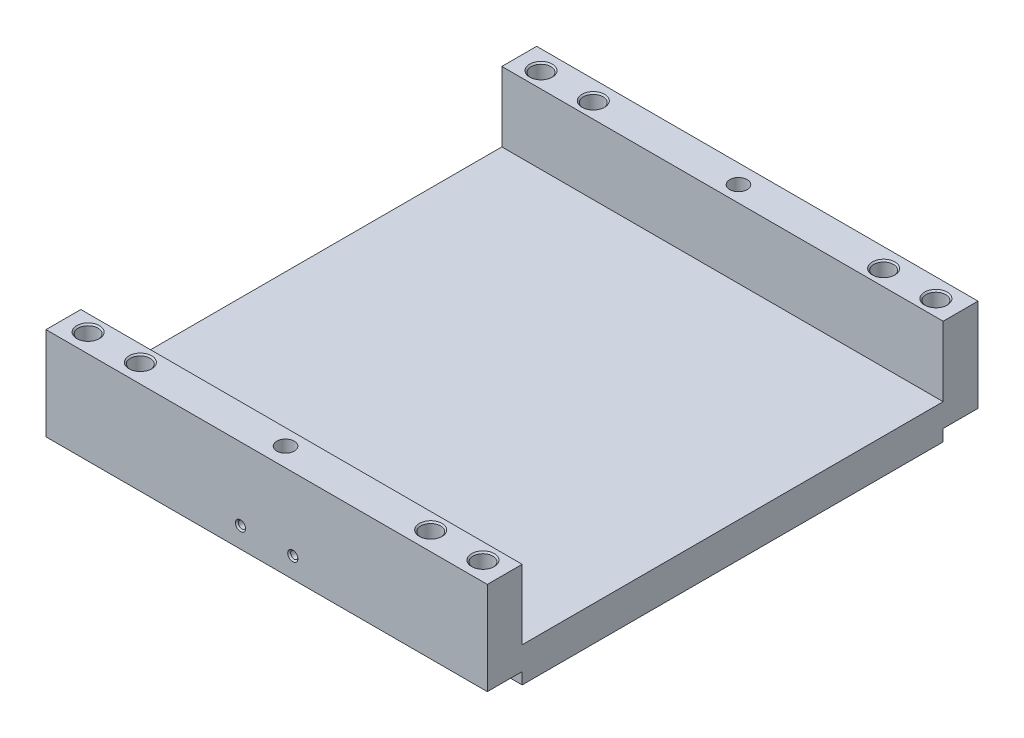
ISO-10303-21;
HEADER;
FILE_DESCRIPTION(('STEP AP214'),'2;1');
FILE_NAME('part.step','',(''),(''),'','','');
FILE_SCHEMA(('AUTOMOTIVE_DESIGN { 1 0 10303 214 1 1 1 1 }'));
ENDSEC;
DATA;
#1=APPLICATION_CONTEXT('core data for automotive mechanical design processes');
#2=APPLICATION_PROTOCOL_DEFINITION('international standard','automotive_design',2000,#1);
#3=PRODUCT_CONTEXT('',#1,'mechanical');
#4=PRODUCT('Part','Part','',(#3));
#5=PRODUCT_RELATED_PRODUCT_CATEGORY('part','',(#4));
#6=PRODUCT_DEFINITION_FORMATION('','',#4);
#7=PRODUCT_DEFINITION_CONTEXT('part definition',#1,'design');
#8=PRODUCT_DEFINITION('design','',#6,#7);
#9=PRODUCT_DEFINITION_SHAPE('','',#8);
#10=(LENGTH_UNIT() NAMED_UNIT(*) SI_UNIT(.MILLI.,.METRE.));
#11=(NAMED_UNIT(*) PLANE_ANGLE_UNIT() SI_UNIT($,.RADIAN.));
#12=(NAMED_UNIT(*) SI_UNIT($,.STERADIAN.) SOLID_ANGLE_UNIT());
#13=UNCERTAINTY_MEASURE_WITH_UNIT(LENGTH_MEASURE(1.E-05),#10,'distance_accuracy_value','');
#14=(GEOMETRIC_REPRESENTATION_CONTEXT(3) GLOBAL_UNCERTAINTY_ASSIGNED_CONTEXT((#13)) GLOBAL_UNIT_ASSIGNED_CONTEXT((#10,
#11,#12)) REPRESENTATION_CONTEXT('',''));
#15=CARTESIAN_POINT('',(0.,0.,0.));
#16=DIRECTION('',(0.,0.,1.));
#17=DIRECTION('',(1.,0.,0.));
#18=AXIS2_PLACEMENT_3D('',#15,#16,#17);
#19=CARTESIAN_POINT('',(-90.5,72.,-77.5));
#20=DIRECTION('',(0.,0.,1.));
#21=DIRECTION('',(1.,0.,0.));
#22=AXIS2_PLACEMENT_3D('',#19,#20,#21);
#23=PLANE('',#22);
#24=CARTESIAN_POINT('',(-90.5,72.,-77.5));
#25=DIRECTION('',(0.,0.,1.));
#26=DIRECTION('',(1.,0.,0.));
#27=AXIS2_PLACEMENT_3D('',#24,#25,#26);
#28=CIRCLE('',#27,1.25);
#29=CARTESIAN_POINT('',(-89.25,72.,-77.5));
#30=VERTEX_POINT('',#29);
#31=EDGE_CURVE('E20',#30,#30,#28,.F.);
#32=ORIENTED_EDGE('',*,*,#31,.T.);
#33=EDGE_LOOP('',(#32));
#34=FACE_BOUND('',#33,.T.);
#35=ADVANCED_FACE('F17',(#34),#23,.F.);
#36=CARTESIAN_POINT('',(-72.5,72.,-77.5));
#37=DIRECTION('',(0.,0.,1.));
#38=DIRECTION('',(1.,0.,0.));
#39=AXIS2_PLACEMENT_3D('',#36,#37,#38);
#40=PLANE('',#39);
#41=CARTESIAN_POINT('',(-72.5,72.,-77.5));
#42=DIRECTION('',(0.,0.,1.));
#43=DIRECTION('',(1.,0.,0.));
#44=AXIS2_PLACEMENT_3D('',#41,#42,#43);
#45=CIRCLE('',#44,1.25);
#46=CARTESIAN_POINT('',(-71.25,72.,-77.5));
#47=VERTEX_POINT('',#46);
#48=EDGE_CURVE('E323',#47,#47,#45,.F.);
#49=ORIENTED_EDGE('',*,*,#48,.T.);
#50=EDGE_LOOP('',(#49));
#51=FACE_BOUND('',#50,.T.);
#52=ADVANCED_FACE('F468',(#51),#40,.F.);
#53=CARTESIAN_POINT('',(-90.5,72.,-84.30320369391));
#54=DIRECTION('',(0.,0.,1.));
#55=DIRECTION('',(1.,0.,0.));
#56=AXIS2_PLACEMENT_3D('',#53,#54,#55);
#57=CYLINDRICAL_SURFACE('',#56,1.25);
#58=ORIENTED_EDGE('',*,*,#31,.F.);
#59=EDGE_LOOP('',(#58));
#60=FACE_BOUND('',#59,.T.);
#61=CARTESIAN_POINT('',(-90.5,72.,-84.0000000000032));
#62=DIRECTION('',(0.,0.,-1.));
#63=DIRECTION('',(-1.,0.,0.));
#64=AXIS2_PLACEMENT_3D('',#61,#62,#63);
#65=CIRCLE('',#64,1.24999999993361);
#66=CARTESIAN_POINT('',(-91.7499999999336,72.,-84.0000000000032));
#67=VERTEX_POINT('',#66);
#68=EDGE_CURVE('E318',#67,#67,#65,.T.);
#69=ORIENTED_EDGE('',*,*,#68,.T.);
#70=EDGE_LOOP('',(#69));
#71=FACE_BOUND('',#70,.T.);
#72=ADVANCED_FACE('F464',(#60,#71),#57,.F.);
#73=CARTESIAN_POINT('',(-72.5,72.,-84.30320369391));
#74=DIRECTION('',(0.,0.,1.));
#75=DIRECTION('',(1.,0.,0.));
#76=AXIS2_PLACEMENT_3D('',#73,#74,#75);
#77=CYLINDRICAL_SURFACE('',#76,1.25);
#78=ORIENTED_EDGE('',*,*,#48,.F.);
#79=EDGE_LOOP('',(#78));
#80=FACE_BOUND('',#79,.T.);
#81=CARTESIAN_POINT('',(-72.5,72.,-84.0000000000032));
#82=DIRECTION('',(0.,0.,-1.));
#83=DIRECTION('',(-1.,0.,0.));
#84=AXIS2_PLACEMENT_3D('',#81,#82,#83);
#85=CIRCLE('',#84,1.25000000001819);
#86=CARTESIAN_POINT('',(-73.7500000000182,72.,-84.0000000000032));
#87=VERTEX_POINT('',#86);
#88=EDGE_CURVE('E224',#87,#87,#85,.T.);
#89=ORIENTED_EDGE('',*,*,#88,.T.);
#90=EDGE_LOOP('',(#89));
#91=FACE_BOUND('',#90,.T.);
#92=ADVANCED_FACE('F467',(#80,#91),#77,.F.);
#93=CARTESIAN_POINT('',(-81.5,49.,-92.));
#94=DIRECTION('',(0.,1.,0.));
#95=DIRECTION('',(0.,0.,1.));
#96=AXIS2_PLACEMENT_3D('',#93,#94,#95);
#97=PLANE('',#96);
#98=DIRECTION('',(0.,0.,1.));
#99=VECTOR('',#98,1.);
#100=CARTESIAN_POINT('',(-86.5,49.,-92.));
#101=LINE('',#100,#99);
#102=CARTESIAN_POINT('',(-86.5,49.,-92.5));
#103=VERTEX_POINT('',#102);
#104=CARTESIAN_POINT('',(-86.5,49.,-91.5));
#105=VERTEX_POINT('',#104);
#106=EDGE_CURVE('E316',#103,#105,#101,.T.);
#107=ORIENTED_EDGE('',*,*,#106,.F.);
#108=DIRECTION('',(1.,0.,0.));
#109=VECTOR('',#108,1.);
#110=CARTESIAN_POINT('',(-81.5,49.,-92.5));
#111=LINE('',#110,#109);
#112=CARTESIAN_POINT('',(-76.5,49.,-92.5));
#113=VERTEX_POINT('',#112);
#114=EDGE_CURVE('E234',#103,#113,#111,.T.);
#115=ORIENTED_EDGE('',*,*,#114,.T.);
#116=DIRECTION('',(0.,0.,1.));
#117=VECTOR('',#116,1.);
#118=CARTESIAN_POINT('',(-76.5,49.,-92.));
#119=LINE('',#118,#117);
#120=CARTESIAN_POINT('',(-76.5,49.,-91.5));
#121=VERTEX_POINT('',#120);
#122=EDGE_CURVE('E319',#121,#113,#119,.F.);
#123=ORIENTED_EDGE('',*,*,#122,.F.);
#124=DIRECTION('',(1.,0.,0.));
#125=VECTOR('',#124,1.);
#126=CARTESIAN_POINT('',(-81.5,49.,-91.5));
#127=LINE('',#126,#125);
#128=EDGE_CURVE('E223',#105,#121,#127,.T.);
#129=ORIENTED_EDGE('',*,*,#128,.F.);
#130=EDGE_LOOP('',(#107,#115,#123,#129));
#131=FACE_BOUND('',#130,.T.);
#132=ADVANCED_FACE('F476',(#131),#97,.F.);
#133=CARTESIAN_POINT('',(-90.5,72.,-84.4999999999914));
#134=DIRECTION('',(0.,0.,-1.));
#135=DIRECTION('',(-1.,0.,0.));
#136=AXIS2_PLACEMENT_3D('',#133,#134,#135);
#137=CONICAL_SURFACE('',#136,1.74999999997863,0.785398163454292);
#138=ORIENTED_EDGE('',*,*,#68,.F.);
#139=EDGE_LOOP('',(#138));
#140=FACE_BOUND('',#139,.T.);
#141=CARTESIAN_POINT('',(-90.5,72.,-84.5));
#142=DIRECTION('',(0.,0.,1.));
#143=DIRECTION('',(1.,0.,0.));
#144=AXIS2_PLACEMENT_3D('',#141,#142,#143);
#145=CIRCLE('',#144,1.75);
#146=CARTESIAN_POINT('',(-88.75,72.,-84.5));
#147=VERTEX_POINT('',#146);
#148=EDGE_CURVE('E295',#147,#147,#145,.F.);
#149=ORIENTED_EDGE('',*,*,#148,.T.);
#150=EDGE_LOOP('',(#149));
#151=FACE_BOUND('',#150,.T.);
#152=ADVANCED_FACE('F472',(#140,#151),#137,.F.);
#153=CARTESIAN_POINT('',(-72.5,72.,-84.4999999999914));
#154=DIRECTION('',(0.,0.,-1.));
#155=DIRECTION('',(-1.,0.,0.));
#156=AXIS2_PLACEMENT_3D('',#153,#154,#155);
#157=CONICAL_SURFACE('',#156,1.75000000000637,0.785398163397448);
#158=ORIENTED_EDGE('',*,*,#88,.F.);
#159=EDGE_LOOP('',(#158));
#160=FACE_BOUND('',#159,.T.);
#161=CARTESIAN_POINT('',(-72.5,72.,-84.5));
#162=DIRECTION('',(0.,0.,1.));
#163=DIRECTION('',(1.,0.,0.));
#164=AXIS2_PLACEMENT_3D('',#161,#162,#163);
#165=CIRCLE('',#164,1.75);
#166=CARTESIAN_POINT('',(-70.75,72.,-84.5));
#167=VERTEX_POINT('',#166);
#168=EDGE_CURVE('E310',#167,#167,#165,.F.);
#169=ORIENTED_EDGE('',*,*,#168,.T.);
#170=EDGE_LOOP('',(#169));
#171=FACE_BOUND('',#170,.T.);
#172=ADVANCED_FACE('F475',(#160,#171),#157,.F.);
#173=CARTESIAN_POINT('',(-149.5,77.,78.));
#174=DIRECTION('',(0.,1.,0.));
#175=DIRECTION('',(0.,0.,1.));
#176=AXIS2_PLACEMENT_3D('',#173,#174,#175);
#177=PLANE('',#176);
#178=CARTESIAN_POINT('',(-149.5,77.,78.));
#179=DIRECTION('',(0.,1.,0.));
#180=DIRECTION('',(0.,0.,1.));
#181=AXIS2_PLACEMENT_3D('',#178,#179,#180);
#182=CIRCLE('',#181,3.4);
#183=CARTESIAN_POINT('',(-149.5,77.,81.4));
#184=VERTEX_POINT('',#183);
#185=EDGE_CURVE('E313',#184,#184,#182,.T.);
#186=ORIENTED_EDGE('',*,*,#185,.T.);
#187=EDGE_LOOP('',(#186));
#188=FACE_BOUND('',#187,.T.);
#189=ADVANCED_FACE('F943',(#188),#177,.T.);
#190=CARTESIAN_POINT('',(-131.5,77.,78.));
#191=DIRECTION('',(0.,1.,0.));
#192=DIRECTION('',(0.,0.,1.));
#193=AXIS2_PLACEMENT_3D('',#190,#191,#192);
#194=PLANE('',#193);
#195=CARTESIAN_POINT('',(-131.5,77.,78.));
#196=DIRECTION('',(0.,1.,0.));
#197=DIRECTION('',(0.,0.,1.));
#198=AXIS2_PLACEMENT_3D('',#195,#196,#197);
#199=CIRCLE('',#198,3.4);
#200=CARTESIAN_POINT('',(-131.5,77.,81.4));
#201=VERTEX_POINT('',#200);
#202=EDGE_CURVE('E453',#201,#201,#199,.T.);
#203=ORIENTED_EDGE('',*,*,#202,.T.);
#204=EDGE_LOOP('',(#203));
#205=FACE_BOUND('',#204,.T.);
#206=ADVANCED_FACE('F939',(#205),#194,.T.);
#207=CARTESIAN_POINT('',(-31.5,77.,78.));
#208=DIRECTION('',(0.,1.,0.));
#209=DIRECTION('',(0.,0.,1.));
#210=AXIS2_PLACEMENT_3D('',#207,#208,#209);
#211=PLANE('',#210);
#212=CARTESIAN_POINT('',(-31.5,77.,78.));
#213=DIRECTION('',(0.,1.,0.));
#214=DIRECTION('',(0.,0.,1.));
#215=AXIS2_PLACEMENT_3D('',#212,#213,#214);
#216=CIRCLE('',#215,3.4);
#217=CARTESIAN_POINT('',(-31.5,77.,81.4));
#218=VERTEX_POINT('',#217);
#219=EDGE_CURVE('E450',#218,#218,#216,.T.);
#220=ORIENTED_EDGE('',*,*,#219,.T.);
#221=EDGE_LOOP('',(#220));
#222=FACE_BOUND('',#221,.T.);
#223=ADVANCED_FACE('F935',(#222),#211,.T.);
#224=CARTESIAN_POINT('',(-13.5,77.,78.));
#225=DIRECTION('',(0.,1.,0.));
#226=DIRECTION('',(0.,0.,1.));
#227=AXIS2_PLACEMENT_3D('',#224,#225,#226);
#228=PLANE('',#227);
#229=CARTESIAN_POINT('',(-13.5,77.,78.));
#230=DIRECTION('',(0.,1.,0.));
#231=DIRECTION('',(0.,0.,1.));
#232=AXIS2_PLACEMENT_3D('',#229,#230,#231);
#233=CIRCLE('',#232,3.4);
#234=CARTESIAN_POINT('',(-13.5,77.,81.4));
#235=VERTEX_POINT('',#234);
#236=EDGE_CURVE('E447',#235,#235,#233,.T.);
#237=ORIENTED_EDGE('',*,*,#236,.T.);
#238=EDGE_LOOP('',(#237));
#239=FACE_BOUND('',#238,.T.);
#240=ADVANCED_FACE('F931',(#239),#228,.T.);
#241=CARTESIAN_POINT('',(-90.5,72.,77.5));
#242=DIRECTION('',(0.,0.,1.));
#243=DIRECTION('',(1.,0.,0.));
#244=AXIS2_PLACEMENT_3D('',#241,#242,#243);
#245=PLANE('',#244);
#246=CARTESIAN_POINT('',(-90.5,72.,77.5));
#247=DIRECTION('',(0.,0.,1.));
#248=DIRECTION('',(1.,0.,0.));
#249=AXIS2_PLACEMENT_3D('',#246,#247,#248);
#250=CIRCLE('',#249,1.25);
#251=CARTESIAN_POINT('',(-89.25,72.,77.5));
#252=VERTEX_POINT('',#251);
#253=EDGE_CURVE('E444',#252,#252,#250,.T.);
#254=ORIENTED_EDGE('',*,*,#253,.T.);
#255=EDGE_LOOP('',(#254));
#256=FACE_BOUND('',#255,.T.);
#257=ADVANCED_FACE('F927',(#256),#245,.T.);
#258=CARTESIAN_POINT('',(-72.5,72.,77.5));
#259=DIRECTION('',(0.,0.,1.));
#260=DIRECTION('',(1.,0.,0.));
#261=AXIS2_PLACEMENT_3D('',#258,#259,#260);
#262=PLANE('',#261);
#263=CARTESIAN_POINT('',(-72.5,72.,77.5));
#264=DIRECTION('',(0.,0.,1.));
#265=DIRECTION('',(1.,0.,0.));
#266=AXIS2_PLACEMENT_3D('',#263,#264,#265);
#267=CIRCLE('',#266,1.25);
#268=CARTESIAN_POINT('',(-71.25,72.,77.5));
#269=VERTEX_POINT('',#268);
#270=EDGE_CURVE('E272',#269,#269,#267,.T.);
#271=ORIENTED_EDGE('',*,*,#270,.T.);
#272=EDGE_LOOP('',(#271));
#273=FACE_BOUND('',#272,.T.);
#274=ADVANCED_FACE('F924',(#273),#262,.T.);
#275=CARTESIAN_POINT('',(-76.19679630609,65.,-90.5));
#276=DIRECTION('',(-1.,0.,0.));
#277=DIRECTION('',(0.,0.,1.));
#278=AXIS2_PLACEMENT_3D('',#275,#276,#277);
#279=CYLINDRICAL_SURFACE('',#278,1.);
#280=DIRECTION('',(1.,0.,0.));
#281=VECTOR('',#280,1.);
#282=CARTESIAN_POINT('',(-81.5,65.,-91.5));
#283=LINE('',#282,#281);
#284=CARTESIAN_POINT('',(-76.5,65.,-91.5));
#285=VERTEX_POINT('',#284);
#286=CARTESIAN_POINT('',(-86.5,65.,-91.5));
#287=VERTEX_POINT('',#286);
#288=EDGE_CURVE('E227',#285,#287,#283,.F.);
#289=ORIENTED_EDGE('',*,*,#288,.F.);
#290=CARTESIAN_POINT('',(-76.5,65.,-90.5));
#291=DIRECTION('',(-1.,0.,0.));
#292=DIRECTION('',(0.,0.,1.));
#293=AXIS2_PLACEMENT_3D('',#290,#291,#292);
#294=CIRCLE('',#293,1.);
#295=CARTESIAN_POINT('',(-76.5,66.,-90.5));
#296=VERTEX_POINT('',#295);
#297=EDGE_CURVE('E212',#296,#285,#294,.T.);
#298=ORIENTED_EDGE('',*,*,#297,.F.);
#299=DIRECTION('',(1.,0.,0.));
#300=VECTOR('',#299,1.);
#301=CARTESIAN_POINT('',(-81.5,66.,-90.5));
#302=LINE('',#301,#300);
#303=CARTESIAN_POINT('',(-86.5,66.,-90.5));
#304=VERTEX_POINT('',#303);
#305=EDGE_CURVE('E257',#296,#304,#302,.F.);
#306=ORIENTED_EDGE('',*,*,#305,.T.);
#307=CARTESIAN_POINT('',(-86.5,65.,-90.5));
#308=DIRECTION('',(-1.,0.,0.));
#309=DIRECTION('',(0.,0.,1.));
#310=AXIS2_PLACEMENT_3D('',#307,#308,#309);
#311=CIRCLE('',#310,1.);
#312=EDGE_CURVE('E230',#304,#287,#311,.T.);
#313=ORIENTED_EDGE('',*,*,#312,.T.);
#314=EDGE_LOOP('',(#289,#298,#306,#313));
#315=FACE_BOUND('',#314,.T.);
#316=ADVANCED_FACE('F228',(#315),#279,.F.);
#317=CARTESIAN_POINT('',(-81.5,57.,-91.5));
#318=DIRECTION('',(0.,0.,1.));
#319=DIRECTION('',(1.,0.,0.));
#320=AXIS2_PLACEMENT_3D('',#317,#318,#319);
#321=PLANE('',#320);
#322=DIRECTION('',(0.,1.,0.));
#323=VECTOR('',#322,1.);
#324=CARTESIAN_POINT('',(-76.5,58.5,-91.5));
#325=LINE('',#324,#323);
#326=EDGE_CURVE('E220',#285,#121,#325,.F.);
#327=ORIENTED_EDGE('',*,*,#326,.F.);
#328=ORIENTED_EDGE('',*,*,#288,.T.);
#329=DIRECTION('',(0.,1.,0.));
#330=VECTOR('',#329,1.);
#331=CARTESIAN_POINT('',(-86.5,58.5,-91.5));
#332=LINE('',#331,#330);
#333=EDGE_CURVE('E264',#287,#105,#332,.F.);
#334=ORIENTED_EDGE('',*,*,#333,.T.);
#335=ORIENTED_EDGE('',*,*,#128,.T.);
#336=EDGE_LOOP('',(#327,#328,#334,#335));
#337=FACE_BOUND('',#336,.T.);
#338=ADVANCED_FACE('F237',(#337),#321,.T.);
#339=CARTESIAN_POINT('',(-81.5,57.,-92.5));
#340=DIRECTION('',(0.,0.,1.));
#341=DIRECTION('',(1.,0.,0.));
#342=AXIS2_PLACEMENT_3D('',#339,#340,#341);
#343=PLANE('',#342);
#344=ORIENTED_EDGE('',*,*,#114,.F.);
#345=DIRECTION('',(0.,1.,0.));
#346=VECTOR('',#345,1.);
#347=CARTESIAN_POINT('',(-86.5,58.5,-92.5));
#348=LINE('',#347,#346);
#349=CARTESIAN_POINT('',(-86.5,65.,-92.5));
#350=VERTEX_POINT('',#349);
#351=EDGE_CURVE('E262',#103,#350,#348,.T.);
#352=ORIENTED_EDGE('',*,*,#351,.T.);
#353=DIRECTION('',(1.,0.,0.));
#354=VECTOR('',#353,1.);
#355=CARTESIAN_POINT('',(-86.80320369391,65.,-92.5));
#356=LINE('',#355,#354);
#357=CARTESIAN_POINT('',(-76.5,65.,-92.5));
#358=VERTEX_POINT('',#357);
#359=EDGE_CURVE('E299',#358,#350,#356,.F.);
#360=ORIENTED_EDGE('',*,*,#359,.F.);
#361=DIRECTION('',(0.,1.,0.));
#362=VECTOR('',#361,1.);
#363=CARTESIAN_POINT('',(-76.5,58.5,-92.5));
#364=LINE('',#363,#362);
#365=EDGE_CURVE('E239',#113,#358,#364,.T.);
#366=ORIENTED_EDGE('',*,*,#365,.F.);
#367=EDGE_LOOP('',(#344,#352,#360,#366));
#368=FACE_BOUND('',#367,.T.);
#369=ADVANCED_FACE('F908',(#368),#343,.F.);
#370=CARTESIAN_POINT('',(-86.80320369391,65.,-90.5));
#371=DIRECTION('',(1.,0.,0.));
#372=DIRECTION('',(0.,0.,-1.));
#373=AXIS2_PLACEMENT_3D('',#370,#371,#372);
#374=CYLINDRICAL_SURFACE('',#373,2.);
#375=DIRECTION('',(1.,0.,0.));
#376=VECTOR('',#375,1.);
#377=CARTESIAN_POINT('',(-81.5,67.,-90.5));
#378=LINE('',#377,#376);
#379=CARTESIAN_POINT('',(-76.5,67.,-90.5));
#380=VERTEX_POINT('',#379);
#381=CARTESIAN_POINT('',(-86.5,67.,-90.5));
#382=VERTEX_POINT('',#381);
#383=EDGE_CURVE('E296',#380,#382,#378,.F.);
#384=ORIENTED_EDGE('',*,*,#383,.F.);
#385=CARTESIAN_POINT('',(-76.5,65.,-90.5));
#386=DIRECTION('',(1.,0.,0.));
#387=DIRECTION('',(0.,0.,-1.));
#388=AXIS2_PLACEMENT_3D('',#385,#386,#387);
#389=CIRCLE('',#388,2.);
#390=EDGE_CURVE('E242',#358,#380,#389,.T.);
#391=ORIENTED_EDGE('',*,*,#390,.F.);
#392=ORIENTED_EDGE('',*,*,#359,.T.);
#393=CARTESIAN_POINT('',(-86.5,65.,-90.5));
#394=DIRECTION('',(1.,0.,0.));
#395=DIRECTION('',(0.,0.,-1.));
#396=AXIS2_PLACEMENT_3D('',#393,#394,#395);
#397=CIRCLE('',#396,2.);
#398=EDGE_CURVE('E261',#350,#382,#397,.T.);
#399=ORIENTED_EDGE('',*,*,#398,.T.);
#400=EDGE_LOOP('',(#384,#391,#392,#399));
#401=FACE_BOUND('',#400,.T.);
#402=ADVANCED_FACE('F910',(#401),#374,.T.);
#403=CARTESIAN_POINT('',(-81.5,67.,-88.5));
#404=DIRECTION('',(0.,1.,0.));
#405=DIRECTION('',(0.,0.,1.));
#406=AXIS2_PLACEMENT_3D('',#403,#404,#405);
#407=PLANE('',#406);
#408=DIRECTION('',(0.,0.,-1.));
#409=VECTOR('',#408,1.);
#410=CARTESIAN_POINT('',(-86.5,67.,-88.5));
#411=LINE('',#410,#409);
#412=CARTESIAN_POINT('',(-86.5,67.,-86.5));
#413=VERTEX_POINT('',#412);
#414=EDGE_CURVE('E258',#382,#413,#411,.F.);
#415=ORIENTED_EDGE('',*,*,#414,.T.);
#416=DIRECTION('',(-1.,0.,0.));
#417=VECTOR('',#416,1.);
#418=CARTESIAN_POINT('',(-76.19679630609,67.,-86.5));
#419=LINE('',#418,#417);
#420=CARTESIAN_POINT('',(-76.5,67.,-86.5));
#421=VERTEX_POINT('',#420);
#422=EDGE_CURVE('E293',#413,#421,#419,.F.);
#423=ORIENTED_EDGE('',*,*,#422,.T.);
#424=DIRECTION('',(0.,0.,-1.));
#425=VECTOR('',#424,1.);
#426=CARTESIAN_POINT('',(-76.5,67.,-88.5));
#427=LINE('',#426,#425);
#428=EDGE_CURVE('E436',#380,#421,#427,.F.);
#429=ORIENTED_EDGE('',*,*,#428,.F.);
#430=ORIENTED_EDGE('',*,*,#383,.T.);
#431=EDGE_LOOP('',(#415,#423,#429,#430));
#432=FACE_BOUND('',#431,.T.);
#433=ADVANCED_FACE('F494',(#432),#407,.T.);
#434=CARTESIAN_POINT('',(-76.19679630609,68.,-86.5));
#435=DIRECTION('',(-1.,0.,0.));
#436=DIRECTION('',(0.,0.,1.));
#437=AXIS2_PLACEMENT_3D('',#434,#435,#436);
#438=CYLINDRICAL_SURFACE('',#437,1.);
#439=DIRECTION('',(1.,0.,0.));
#440=VECTOR('',#439,1.);
#441=CARTESIAN_POINT('',(-81.5,68.,-85.5));
#442=LINE('',#441,#440);
#443=CARTESIAN_POINT('',(-86.5,68.,-85.5));
#444=VERTEX_POINT('',#443);
#445=CARTESIAN_POINT('',(-76.5,68.,-85.5));
#446=VERTEX_POINT('',#445);
#447=EDGE_CURVE('E433',#444,#446,#442,.T.);
#448=ORIENTED_EDGE('',*,*,#447,.T.);
#449=CARTESIAN_POINT('',(-76.5,68.,-86.5));
#450=DIRECTION('',(-1.,0.,0.));
#451=DIRECTION('',(0.,0.,1.));
#452=AXIS2_PLACEMENT_3D('',#449,#450,#451);
#453=CIRCLE('',#452,1.);
#454=EDGE_CURVE('E434',#421,#446,#453,.T.);
#455=ORIENTED_EDGE('',*,*,#454,.F.);
#456=ORIENTED_EDGE('',*,*,#422,.F.);
#457=CARTESIAN_POINT('',(-86.5,68.,-86.5));
#458=DIRECTION('',(-1.,0.,0.));
#459=DIRECTION('',(0.,0.,1.));
#460=AXIS2_PLACEMENT_3D('',#457,#458,#459);
#461=CIRCLE('',#460,1.);
#462=EDGE_CURVE('E260',#413,#444,#461,.T.);
#463=ORIENTED_EDGE('',*,*,#462,.T.);
#464=EDGE_LOOP('',(#448,#455,#456,#463));
#465=FACE_BOUND('',#464,.T.);
#466=ADVANCED_FACE('F483',(#465),#438,.F.);
#467=CARTESIAN_POINT('',(-90.5,72.,-85.80320369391));
#468=DIRECTION('',(0.,0.,1.));
#469=DIRECTION('',(1.,0.,0.));
#470=AXIS2_PLACEMENT_3D('',#467,#468,#469);
#471=CYLINDRICAL_SURFACE('',#470,1.75);
#472=CARTESIAN_POINT('',(-90.5,72.,-85.5));
#473=DIRECTION('',(0.,0.,1.));
#474=DIRECTION('',(1.,0.,0.));
#475=AXIS2_PLACEMENT_3D('',#472,#473,#474);
#476=CIRCLE('',#475,1.75);
#477=CARTESIAN_POINT('',(-88.75,72.,-85.5));
#478=VERTEX_POINT('',#477);
#479=EDGE_CURVE('E430',#478,#478,#476,.F.);
#480=ORIENTED_EDGE('',*,*,#479,.T.);
#481=EDGE_LOOP('',(#480));
#482=FACE_BOUND('',#481,.T.);
#483=ORIENTED_EDGE('',*,*,#148,.F.);
#484=EDGE_LOOP('',(#483));
#485=FACE_BOUND('',#484,.T.);
#486=ADVANCED_FACE('F480',(#482,#485),#471,.F.);
#487=CARTESIAN_POINT('',(-72.5,72.,-85.80320369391));
#488=DIRECTION('',(0.,0.,1.));
#489=DIRECTION('',(1.,0.,0.));
#490=AXIS2_PLACEMENT_3D('',#487,#488,#489);
#491=CYLINDRICAL_SURFACE('',#490,1.75);
#492=CARTESIAN_POINT('',(-72.5,72.,-85.5));
#493=DIRECTION('',(0.,0.,1.));
#494=DIRECTION('',(1.,0.,0.));
#495=AXIS2_PLACEMENT_3D('',#492,#493,#494);
#496=CIRCLE('',#495,1.75);
#497=CARTESIAN_POINT('',(-70.75,72.,-85.5));
#498=VERTEX_POINT('',#497);
#499=EDGE_CURVE('E427',#498,#498,#496,.F.);
#500=ORIENTED_EDGE('',*,*,#499,.T.);
#501=EDGE_LOOP('',(#500));
#502=FACE_BOUND('',#501,.T.);
#503=ORIENTED_EDGE('',*,*,#168,.F.);
#504=EDGE_LOOP('',(#503));
#505=FACE_BOUND('',#504,.T.);
#506=ADVANCED_FACE('F482',(#502,#505),#491,.F.);
#507=CARTESIAN_POINT('',(-149.5,77.,-78.));
#508=DIRECTION('',(0.,1.,0.));
#509=DIRECTION('',(0.,0.,1.));
#510=AXIS2_PLACEMENT_3D('',#507,#508,#509);
#511=PLANE('',#510);
#512=CARTESIAN_POINT('',(-149.5,77.,-78.));
#513=DIRECTION('',(0.,1.,0.));
#514=DIRECTION('',(0.,0.,1.));
#515=AXIS2_PLACEMENT_3D('',#512,#513,#514);
#516=CIRCLE('',#515,3.4);
#517=CARTESIAN_POINT('',(-149.5,77.,-74.6));
#518=VERTEX_POINT('',#517);
#519=EDGE_CURVE('E424',#518,#518,#516,.T.);
#520=ORIENTED_EDGE('',*,*,#519,.T.);
#521=EDGE_LOOP('',(#520));
#522=FACE_BOUND('',#521,.T.);
#523=ADVANCED_FACE('F491',(#522),#511,.T.);
#524=CARTESIAN_POINT('',(-131.5,77.,-78.));
#525=DIRECTION('',(0.,1.,0.));
#526=DIRECTION('',(0.,0.,1.));
#527=AXIS2_PLACEMENT_3D('',#524,#525,#526);
#528=PLANE('',#527);
#529=CARTESIAN_POINT('',(-131.5,77.,-78.));
#530=DIRECTION('',(0.,1.,0.));
#531=DIRECTION('',(0.,0.,1.));
#532=AXIS2_PLACEMENT_3D('',#529,#530,#531);
#533=CIRCLE('',#532,3.4);
#534=CARTESIAN_POINT('',(-131.5,77.,-74.6));
#535=VERTEX_POINT('',#534);
#536=EDGE_CURVE('E421',#535,#535,#533,.T.);
#537=ORIENTED_EDGE('',*,*,#536,.T.);
#538=EDGE_LOOP('',(#537));
#539=FACE_BOUND('',#538,.T.);
#540=ADVANCED_FACE('F713',(#539),#528,.T.);
#541=CARTESIAN_POINT('',(-31.5,77.,-78.));
#542=DIRECTION('',(0.,1.,0.));
#543=DIRECTION('',(0.,0.,1.));
#544=AXIS2_PLACEMENT_3D('',#541,#542,#543);
#545=PLANE('',#544);
#546=CARTESIAN_POINT('',(-31.5,77.,-78.));
#547=DIRECTION('',(0.,1.,0.));
#548=DIRECTION('',(0.,0.,1.));
#549=AXIS2_PLACEMENT_3D('',#546,#547,#548);
#550=CIRCLE('',#549,3.4);
#551=CARTESIAN_POINT('',(-31.5,77.,-74.6));
#552=VERTEX_POINT('',#551);
#553=EDGE_CURVE('E418',#552,#552,#550,.T.);
#554=ORIENTED_EDGE('',*,*,#553,.T.);
#555=EDGE_LOOP('',(#554));
#556=FACE_BOUND('',#555,.T.);
#557=ADVANCED_FACE('F709',(#556),#545,.T.);
#558=CARTESIAN_POINT('',(-13.5,77.,-78.));
#559=DIRECTION('',(0.,1.,0.));
#560=DIRECTION('',(0.,0.,1.));
#561=AXIS2_PLACEMENT_3D('',#558,#559,#560);
#562=PLANE('',#561);
#563=CARTESIAN_POINT('',(-13.5,77.,-78.));
#564=DIRECTION('',(0.,1.,0.));
#565=DIRECTION('',(0.,0.,1.));
#566=AXIS2_PLACEMENT_3D('',#563,#564,#565);
#567=CIRCLE('',#566,3.4);
#568=CARTESIAN_POINT('',(-13.5,77.,-74.6));
#569=VERTEX_POINT('',#568);
#570=EDGE_CURVE('E415',#569,#569,#567,.T.);
#571=ORIENTED_EDGE('',*,*,#570,.T.);
#572=EDGE_LOOP('',(#571));
#573=FACE_BOUND('',#572,.T.);
#574=ADVANCED_FACE('F705',(#573),#562,.T.);
#575=CARTESIAN_POINT('',(-81.5,82.,78.));
#576=DIRECTION('',(0.,1.,0.));
#577=DIRECTION('',(0.,0.,1.));
#578=AXIS2_PLACEMENT_3D('',#575,#576,#577);
#579=PLANE('',#578);
#580=CARTESIAN_POINT('',(-81.5,82.,78.));
#581=DIRECTION('',(0.,1.,0.));
#582=DIRECTION('',(0.,0.,1.));
#583=AXIS2_PLACEMENT_3D('',#580,#581,#582);
#584=CIRCLE('',#583,3.);
#585=CARTESIAN_POINT('',(-81.5,82.,81.));
#586=VERTEX_POINT('',#585);
#587=EDGE_CURVE('E292',#586,#586,#584,.T.);
#588=ORIENTED_EDGE('',*,*,#587,.T.);
#589=EDGE_LOOP('',(#588));
#590=FACE_BOUND('',#589,.T.);
#591=ADVANCED_FACE('F701',(#590),#579,.T.);
#592=CARTESIAN_POINT('',(-149.5,76.61,78.));
#593=DIRECTION('',(0.,1.,0.));
#594=DIRECTION('',(0.,0.,1.));
#595=AXIS2_PLACEMENT_3D('',#592,#593,#594);
#596=CYLINDRICAL_SURFACE('',#595,3.4);
#597=ORIENTED_EDGE('',*,*,#185,.F.);
#598=EDGE_LOOP('',(#597));
#599=FACE_BOUND('',#598,.T.);
#600=CARTESIAN_POINT('',(-149.5,96.4999999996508,78.));
#601=DIRECTION('',(0.,1.,0.));
#602=DIRECTION('',(-1.,0.,0.));
#603=AXIS2_PLACEMENT_3D('',#600,#601,#602);
#604=CIRCLE('',#603,3.39999999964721);
#605=CARTESIAN_POINT('',(-152.899999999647,96.4999999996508,78.));
#606=VERTEX_POINT('',#605);
#607=EDGE_CURVE('E289',#606,#606,#604,.T.);
#608=ORIENTED_EDGE('',*,*,#607,.T.);
#609=EDGE_LOOP('',(#608));
#610=FACE_BOUND('',#609,.T.);
#611=ADVANCED_FACE('F697',(#599,#610),#596,.F.);
#612=CARTESIAN_POINT('',(-131.5,76.61,78.));
#613=DIRECTION('',(0.,1.,0.));
#614=DIRECTION('',(0.,0.,1.));
#615=AXIS2_PLACEMENT_3D('',#612,#613,#614);
#616=CYLINDRICAL_SURFACE('',#615,3.4);
#617=ORIENTED_EDGE('',*,*,#202,.F.);
#618=EDGE_LOOP('',(#617));
#619=FACE_BOUND('',#618,.T.);
#620=CARTESIAN_POINT('',(-131.5,96.4999999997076,78.));
#621=DIRECTION('',(0.,1.,0.));
#622=DIRECTION('',(-1.,0.,0.));
#623=AXIS2_PLACEMENT_3D('',#620,#621,#622);
#624=CIRCLE('',#623,3.39999999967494);
#625=CARTESIAN_POINT('',(-134.899999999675,96.4999999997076,78.));
#626=VERTEX_POINT('',#625);
#627=EDGE_CURVE('E286',#626,#626,#624,.T.);
#628=ORIENTED_EDGE('',*,*,#627,.T.);
#629=EDGE_LOOP('',(#628));
#630=FACE_BOUND('',#629,.T.);
#631=ADVANCED_FACE('F693',(#619,#630),#616,.F.);
#632=CARTESIAN_POINT('',(-31.5,76.61,78.));
#633=DIRECTION('',(0.,1.,0.));
#634=DIRECTION('',(0.,0.,1.));
#635=AXIS2_PLACEMENT_3D('',#632,#633,#634);
#636=CYLINDRICAL_SURFACE('',#635,3.4);
#637=ORIENTED_EDGE('',*,*,#219,.F.);
#638=EDGE_LOOP('',(#637));
#639=FACE_BOUND('',#638,.T.);
#640=CARTESIAN_POINT('',(-31.5,96.4999999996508,78.));
#641=DIRECTION('',(0.,1.,0.));
#642=DIRECTION('',(-1.,0.,0.));
#643=AXIS2_PLACEMENT_3D('',#640,#641,#642);
#644=CIRCLE('',#643,3.39999999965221);
#645=CARTESIAN_POINT('',(-34.8999999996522,96.4999999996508,78.));
#646=VERTEX_POINT('',#645);
#647=EDGE_CURVE('E283',#646,#646,#644,.T.);
#648=ORIENTED_EDGE('',*,*,#647,.T.);
#649=EDGE_LOOP('',(#648));
#650=FACE_BOUND('',#649,.T.);
#651=ADVANCED_FACE('F689',(#639,#650),#636,.F.);
#652=CARTESIAN_POINT('',(-13.5,76.61,78.));
#653=DIRECTION('',(0.,1.,0.));
#654=DIRECTION('',(0.,0.,1.));
#655=AXIS2_PLACEMENT_3D('',#652,#653,#654);
#656=CYLINDRICAL_SURFACE('',#655,3.4);
#657=ORIENTED_EDGE('',*,*,#236,.F.);
#658=EDGE_LOOP('',(#657));
#659=FACE_BOUND('',#658,.T.);
#660=CARTESIAN_POINT('',(-13.5,96.4999999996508,78.));
#661=DIRECTION('',(0.,1.,0.));
#662=DIRECTION('',(-1.,0.,0.));
#663=AXIS2_PLACEMENT_3D('',#660,#661,#662);
#664=CIRCLE('',#663,3.39999999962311);
#665=CARTESIAN_POINT('',(-16.8999999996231,96.4999999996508,78.));
#666=VERTEX_POINT('',#665);
#667=EDGE_CURVE('E280',#666,#666,#664,.T.);
#668=ORIENTED_EDGE('',*,*,#667,.T.);
#669=EDGE_LOOP('',(#668));
#670=FACE_BOUND('',#669,.T.);
#671=ADVANCED_FACE('F685',(#659,#670),#656,.F.);
#672=CARTESIAN_POINT('',(-90.5,72.,77.19679630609));
#673=DIRECTION('',(0.,0.,1.));
#674=DIRECTION('',(1.,0.,0.));
#675=AXIS2_PLACEMENT_3D('',#672,#673,#674);
#676=CYLINDRICAL_SURFACE('',#675,1.25);
#677=ORIENTED_EDGE('',*,*,#253,.F.);
#678=EDGE_LOOP('',(#677));
#679=FACE_BOUND('',#678,.T.);
#680=CARTESIAN_POINT('',(-90.5,72.,84.0000000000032));
#681=DIRECTION('',(0.,0.,1.));
#682=DIRECTION('',(-1.,0.,0.));
#683=AXIS2_PLACEMENT_3D('',#680,#681,#682);
#684=CIRCLE('',#683,1.24999999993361);
#685=CARTESIAN_POINT('',(-91.7499999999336,72.,84.0000000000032));
#686=VERTEX_POINT('',#685);
#687=EDGE_CURVE('E277',#686,#686,#684,.T.);
#688=ORIENTED_EDGE('',*,*,#687,.T.);
#689=EDGE_LOOP('',(#688));
#690=FACE_BOUND('',#689,.T.);
#691=ADVANCED_FACE('F681',(#679,#690),#676,.F.);
#692=CARTESIAN_POINT('',(-72.5,72.,77.19679630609));
#693=DIRECTION('',(0.,0.,1.));
#694=DIRECTION('',(1.,0.,0.));
#695=AXIS2_PLACEMENT_3D('',#692,#693,#694);
#696=CYLINDRICAL_SURFACE('',#695,1.25);
#697=ORIENTED_EDGE('',*,*,#270,.F.);
#698=EDGE_LOOP('',(#697));
#699=FACE_BOUND('',#698,.T.);
#700=CARTESIAN_POINT('',(-72.5,72.,84.0000000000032));
#701=DIRECTION('',(0.,0.,1.));
#702=DIRECTION('',(-1.,0.,0.));
#703=AXIS2_PLACEMENT_3D('',#700,#701,#702);
#704=CIRCLE('',#703,1.25000000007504);
#705=CARTESIAN_POINT('',(-73.750000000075,72.,84.0000000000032));
#706=VERTEX_POINT('',#705);
#707=EDGE_CURVE('E273',#706,#706,#704,.T.);
#708=ORIENTED_EDGE('',*,*,#707,.T.);
#709=EDGE_LOOP('',(#708));
#710=FACE_BOUND('',#709,.T.);
#711=ADVANCED_FACE('F677',(#699,#710),#696,.F.);
#712=CARTESIAN_POINT('',(-86.5,58.5,-88.5));
#713=DIRECTION('',(1.,0.,0.));
#714=DIRECTION('',(0.,0.,-1.));
#715=AXIS2_PLACEMENT_3D('',#712,#713,#714);
#716=PLANE('',#715);
#717=ORIENTED_EDGE('',*,*,#414,.F.);
#718=ORIENTED_EDGE('',*,*,#398,.F.);
#719=ORIENTED_EDGE('',*,*,#351,.F.);
#720=ORIENTED_EDGE('',*,*,#106,.T.);
#721=ORIENTED_EDGE('',*,*,#333,.F.);
#722=ORIENTED_EDGE('',*,*,#312,.F.);
#723=DIRECTION('',(0.,0.,1.));
#724=VECTOR('',#723,1.);
#725=CARTESIAN_POINT('',(-86.5,66.,-88.5));
#726=LINE('',#725,#724);
#727=CARTESIAN_POINT('',(-86.5,66.,-86.5));
#728=VERTEX_POINT('',#727);
#729=EDGE_CURVE('E244',#304,#728,#726,.T.);
#730=ORIENTED_EDGE('',*,*,#729,.T.);
#731=CARTESIAN_POINT('',(-86.5,68.,-86.5));
#732=DIRECTION('',(1.,0.,0.));
#733=DIRECTION('',(0.,0.,-1.));
#734=AXIS2_PLACEMENT_3D('',#731,#732,#733);
#735=CIRCLE('',#734,2.);
#736=CARTESIAN_POINT('',(-86.5,68.,-84.5));
#737=VERTEX_POINT('',#736);
#738=EDGE_CURVE('E255',#737,#728,#735,.T.);
#739=ORIENTED_EDGE('',*,*,#738,.F.);
#740=DIRECTION('',(0.,0.,-1.));
#741=VECTOR('',#740,1.);
#742=CARTESIAN_POINT('',(-86.5,68.,-88.5));
#743=LINE('',#742,#741);
#744=EDGE_CURVE('E270',#444,#737,#743,.F.);
#745=ORIENTED_EDGE('',*,*,#744,.F.);
#746=ORIENTED_EDGE('',*,*,#462,.F.);
#747=EDGE_LOOP('',(#717,#718,#719,#720,#721,#722,#730,#739,#745,#746));
#748=FACE_BOUND('',#747,.T.);
#749=ADVANCED_FACE('F673',(#748),#716,.F.);
#750=CARTESIAN_POINT('',(-81.5,66.,-88.5));
#751=DIRECTION('',(0.,1.,0.));
#752=DIRECTION('',(0.,0.,1.));
#753=AXIS2_PLACEMENT_3D('',#750,#751,#752);
#754=PLANE('',#753);
#755=ORIENTED_EDGE('',*,*,#305,.F.);
#756=DIRECTION('',(0.,0.,-1.));
#757=VECTOR('',#756,1.);
#758=CARTESIAN_POINT('',(-76.5,66.,-88.5));
#759=LINE('',#758,#757);
#760=CARTESIAN_POINT('',(-76.5,66.,-86.5));
#761=VERTEX_POINT('',#760);
#762=EDGE_CURVE('E222',#761,#296,#759,.T.);
#763=ORIENTED_EDGE('',*,*,#762,.F.);
#764=DIRECTION('',(1.,0.,0.));
#765=VECTOR('',#764,1.);
#766=CARTESIAN_POINT('',(-86.80320369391,66.,-86.5));
#767=LINE('',#766,#765);
#768=EDGE_CURVE('E251',#728,#761,#767,.T.);
#769=ORIENTED_EDGE('',*,*,#768,.F.);
#770=ORIENTED_EDGE('',*,*,#729,.F.);
#771=EDGE_LOOP('',(#755,#763,#769,#770));
#772=FACE_BOUND('',#771,.T.);
#773=ADVANCED_FACE('F670',(#772),#754,.F.);
#774=CARTESIAN_POINT('',(-76.5,58.5,-88.5));
#775=DIRECTION('',(1.,0.,0.));
#776=DIRECTION('',(0.,0.,-1.));
#777=AXIS2_PLACEMENT_3D('',#774,#775,#776);
#778=PLANE('',#777);
#779=ORIENTED_EDGE('',*,*,#454,.T.);
#780=DIRECTION('',(0.,0.,1.));
#781=VECTOR('',#780,1.);
#782=CARTESIAN_POINT('',(-76.5,68.,-85.));
#783=LINE('',#782,#781);
#784=CARTESIAN_POINT('',(-76.5,68.,-84.5));
#785=VERTEX_POINT('',#784);
#786=EDGE_CURVE('E412',#446,#785,#783,.T.);
#787=ORIENTED_EDGE('',*,*,#786,.T.);
#788=CARTESIAN_POINT('',(-76.5,68.,-86.5));
#789=DIRECTION('',(1.,0.,0.));
#790=DIRECTION('',(0.,0.,-1.));
#791=AXIS2_PLACEMENT_3D('',#788,#789,#790);
#792=CIRCLE('',#791,2.);
#793=EDGE_CURVE('E254',#761,#785,#792,.F.);
#794=ORIENTED_EDGE('',*,*,#793,.F.);
#795=ORIENTED_EDGE('',*,*,#762,.T.);
#796=ORIENTED_EDGE('',*,*,#297,.T.);
#797=ORIENTED_EDGE('',*,*,#326,.T.);
#798=ORIENTED_EDGE('',*,*,#122,.T.);
#799=ORIENTED_EDGE('',*,*,#365,.T.);
#800=ORIENTED_EDGE('',*,*,#390,.T.);
#801=ORIENTED_EDGE('',*,*,#428,.T.);
#802=EDGE_LOOP('',(#779,#787,#794,#795,#796,#797,#798,#799,#800,#801));
#803=FACE_BOUND('',#802,.T.);
#804=ADVANCED_FACE('F218',(#803),#778,.T.);
#805=CARTESIAN_POINT('',(-81.5,72.,-85.5));
#806=DIRECTION('',(0.,0.,1.));
#807=DIRECTION('',(1.,0.,0.));
#808=AXIS2_PLACEMENT_3D('',#805,#806,#807);
#809=PLANE('',#808);
#810=ORIENTED_EDGE('',*,*,#499,.F.);
#811=EDGE_LOOP('',(#810));
#812=FACE_BOUND('',#811,.T.);
#813=ORIENTED_EDGE('',*,*,#479,.F.);
#814=EDGE_LOOP('',(#813));
#815=FACE_BOUND('',#814,.T.);
#816=ORIENTED_EDGE('',*,*,#447,.F.);
#817=DIRECTION('',(1.,0.,0.));
#818=VECTOR('',#817,1.);
#819=CARTESIAN_POINT('',(-88.75,68.,-85.5));
#820=LINE('',#819,#818);
#821=CARTESIAN_POINT('',(-91.,68.,-85.5));
#822=VERTEX_POINT('',#821);
#823=EDGE_CURVE('E407',#444,#822,#820,.F.);
#824=ORIENTED_EDGE('',*,*,#823,.T.);
#825=CARTESIAN_POINT('',(-91.,71.,-85.5));
#826=DIRECTION('',(0.,0.,-1.));
#827=DIRECTION('',(-1.,0.,0.));
#828=AXIS2_PLACEMENT_3D('',#825,#826,#827);
#829=CIRCLE('',#828,3.);
#830=CARTESIAN_POINT('',(-94.,71.,-85.5));
#831=VERTEX_POINT('',#830);
#832=EDGE_CURVE('E403',#831,#822,#829,.F.);
#833=ORIENTED_EDGE('',*,*,#832,.F.);
#834=DIRECTION('',(0.,1.,0.));
#835=VECTOR('',#834,1.);
#836=CARTESIAN_POINT('',(-94.,72.,-85.5));
#837=LINE('',#836,#835);
#838=CARTESIAN_POINT('',(-94.,73.,-85.5));
#839=VERTEX_POINT('',#838);
#840=EDGE_CURVE('E402',#831,#839,#837,.T.);
#841=ORIENTED_EDGE('',*,*,#840,.T.);
#842=CARTESIAN_POINT('',(-91.,73.,-85.5));
#843=DIRECTION('',(0.,0.,-1.));
#844=DIRECTION('',(-1.,0.,0.));
#845=AXIS2_PLACEMENT_3D('',#842,#843,#844);
#846=CIRCLE('',#845,3.);
#847=CARTESIAN_POINT('',(-91.,76.,-85.5));
#848=VERTEX_POINT('',#847);
#849=EDGE_CURVE('E398',#848,#839,#846,.F.);
#850=ORIENTED_EDGE('',*,*,#849,.F.);
#851=DIRECTION('',(1.,0.,0.));
#852=VECTOR('',#851,1.);
#853=CARTESIAN_POINT('',(-81.5,76.,-85.5));
#854=LINE('',#853,#852);
#855=CARTESIAN_POINT('',(-72.,76.,-85.5));
#856=VERTEX_POINT('',#855);
#857=EDGE_CURVE('E739',#856,#848,#854,.F.);
#858=ORIENTED_EDGE('',*,*,#857,.F.);
#859=CARTESIAN_POINT('',(-72.,73.,-85.5));
#860=DIRECTION('',(0.,0.,-1.));
#861=DIRECTION('',(-1.,0.,0.));
#862=AXIS2_PLACEMENT_3D('',#859,#860,#861);
#863=CIRCLE('',#862,3.);
#864=CARTESIAN_POINT('',(-69.,73.,-85.5));
#865=VERTEX_POINT('',#864);
#866=EDGE_CURVE('E393',#865,#856,#863,.F.);
#867=ORIENTED_EDGE('',*,*,#866,.F.);
#868=DIRECTION('',(0.,1.,0.));
#869=VECTOR('',#868,1.);
#870=CARTESIAN_POINT('',(-69.,72.,-85.5));
#871=LINE('',#870,#869);
#872=CARTESIAN_POINT('',(-69.,71.,-85.5));
#873=VERTEX_POINT('',#872);
#874=EDGE_CURVE('E733',#873,#865,#871,.T.);
#875=ORIENTED_EDGE('',*,*,#874,.F.);
#876=CARTESIAN_POINT('',(-72.,71.,-85.5));
#877=DIRECTION('',(0.,0.,-1.));
#878=DIRECTION('',(-1.,0.,0.));
#879=AXIS2_PLACEMENT_3D('',#876,#877,#878);
#880=CIRCLE('',#879,3.);
#881=CARTESIAN_POINT('',(-72.,68.,-85.5));
#882=VERTEX_POINT('',#881);
#883=EDGE_CURVE('E389',#882,#873,#880,.F.);
#884=ORIENTED_EDGE('',*,*,#883,.F.);
#885=DIRECTION('',(1.,0.,0.));
#886=VECTOR('',#885,1.);
#887=CARTESIAN_POINT('',(-74.25,68.,-85.5));
#888=LINE('',#887,#886);
#889=EDGE_CURVE('E276',#882,#446,#888,.F.);
#890=ORIENTED_EDGE('',*,*,#889,.T.);
#891=EDGE_LOOP('',(#816,#824,#833,#841,#850,#858,#867,#875,#884,#890));
#892=FACE_BOUND('',#891,.T.);
#893=ADVANCED_FACE('F663',(#812,#815,#892),#809,.F.);
#894=CARTESIAN_POINT('',(-81.5,82.,-78.));
#895=DIRECTION('',(0.,1.,0.));
#896=DIRECTION('',(0.,0.,1.));
#897=AXIS2_PLACEMENT_3D('',#894,#895,#896);
#898=PLANE('',#897);
#899=CARTESIAN_POINT('',(-81.5,82.,-78.));
#900=DIRECTION('',(0.,1.,0.));
#901=DIRECTION('',(0.,0.,1.));
#902=AXIS2_PLACEMENT_3D('',#899,#900,#901);
#903=CIRCLE('',#902,3.);
#904=CARTESIAN_POINT('',(-81.5,82.,-75.));
#905=VERTEX_POINT('',#904);
#906=EDGE_CURVE('E384',#905,#905,#903,.T.);
#907=ORIENTED_EDGE('',*,*,#906,.T.);
#908=EDGE_LOOP('',(#907));
#909=FACE_BOUND('',#908,.T.);
#910=ADVANCED_FACE('F659',(#909),#898,.T.);
#911=CARTESIAN_POINT('',(-149.5,76.61,-78.));
#912=DIRECTION('',(0.,1.,0.));
#913=DIRECTION('',(0.,0.,1.));
#914=AXIS2_PLACEMENT_3D('',#911,#912,#913);
#915=CYLINDRICAL_SURFACE('',#914,3.4);
#916=ORIENTED_EDGE('',*,*,#519,.F.);
#917=EDGE_LOOP('',(#916));
#918=FACE_BOUND('',#917,.T.);
#919=CARTESIAN_POINT('',(-149.5,96.4999999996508,-78.));
#920=DIRECTION('',(0.,1.,0.));
#921=DIRECTION('',(-1.,0.,0.));
#922=AXIS2_PLACEMENT_3D('',#919,#920,#921);
#923=CIRCLE('',#922,3.39999999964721);
#924=CARTESIAN_POINT('',(-152.899999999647,96.4999999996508,-78.));
#925=VERTEX_POINT('',#924);
#926=EDGE_CURVE('E387',#925,#925,#923,.T.);
#927=ORIENTED_EDGE('',*,*,#926,.T.);
#928=EDGE_LOOP('',(#927));
#929=FACE_BOUND('',#928,.T.);
#930=ADVANCED_FACE('F655',(#918,#929),#915,.F.);
#931=CARTESIAN_POINT('',(-131.5,76.61,-78.));
#932=DIRECTION('',(0.,1.,0.));
#933=DIRECTION('',(0.,0.,1.));
#934=AXIS2_PLACEMENT_3D('',#931,#932,#933);
#935=CYLINDRICAL_SURFACE('',#934,3.4);
#936=ORIENTED_EDGE('',*,*,#536,.F.);
#937=EDGE_LOOP('',(#936));
#938=FACE_BOUND('',#937,.T.);
#939=CARTESIAN_POINT('',(-131.5,96.4999999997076,-78.));
#940=DIRECTION('',(0.,1.,0.));
#941=DIRECTION('',(-1.,0.,0.));
#942=AXIS2_PLACEMENT_3D('',#939,#940,#941);
#943=CIRCLE('',#942,3.39999999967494);
#944=CARTESIAN_POINT('',(-134.899999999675,96.4999999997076,-78.));
#945=VERTEX_POINT('',#944);
#946=EDGE_CURVE('E726',#945,#945,#943,.T.);
#947=ORIENTED_EDGE('',*,*,#946,.T.);
#948=EDGE_LOOP('',(#947));
#949=FACE_BOUND('',#948,.T.);
#950=ADVANCED_FACE('F651',(#938,#949),#935,.F.);
#951=CARTESIAN_POINT('',(-31.5,76.61,-78.));
#952=DIRECTION('',(0.,1.,0.));
#953=DIRECTION('',(0.,0.,1.));
#954=AXIS2_PLACEMENT_3D('',#951,#952,#953);
#955=CYLINDRICAL_SURFACE('',#954,3.4);
#956=ORIENTED_EDGE('',*,*,#553,.F.);
#957=EDGE_LOOP('',(#956));
#958=FACE_BOUND('',#957,.T.);
#959=CARTESIAN_POINT('',(-31.5,96.4999999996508,-78.));
#960=DIRECTION('',(0.,1.,0.));
#961=DIRECTION('',(-1.,0.,0.));
#962=AXIS2_PLACEMENT_3D('',#959,#960,#961);
#963=CIRCLE('',#962,3.39999999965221);
#964=CARTESIAN_POINT('',(-34.8999999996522,96.4999999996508,-78.));
#965=VERTEX_POINT('',#964);
#966=EDGE_CURVE('E729',#965,#965,#963,.T.);
#967=ORIENTED_EDGE('',*,*,#966,.T.);
#968=EDGE_LOOP('',(#967));
#969=FACE_BOUND('',#968,.T.);
#970=ADVANCED_FACE('F647',(#958,#969),#955,.F.);
#971=CARTESIAN_POINT('',(-13.5,76.61,-78.));
#972=DIRECTION('',(0.,1.,0.));
#973=DIRECTION('',(0.,0.,1.));
#974=AXIS2_PLACEMENT_3D('',#971,#972,#973);
#975=CYLINDRICAL_SURFACE('',#974,3.4);
#976=ORIENTED_EDGE('',*,*,#570,.F.);
#977=EDGE_LOOP('',(#976));
#978=FACE_BOUND('',#977,.T.);
#979=CARTESIAN_POINT('',(-13.5,96.4999999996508,-78.));
#980=DIRECTION('',(0.,1.,0.));
#981=DIRECTION('',(-1.,0.,0.));
#982=AXIS2_PLACEMENT_3D('',#979,#980,#981);
#983=CIRCLE('',#982,3.39999999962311);
#984=CARTESIAN_POINT('',(-16.8999999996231,96.4999999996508,-78.));
#985=VERTEX_POINT('',#984);
#986=EDGE_CURVE('E383',#985,#985,#983,.T.);
#987=ORIENTED_EDGE('',*,*,#986,.T.);
#988=EDGE_LOOP('',(#987));
#989=FACE_BOUND('',#988,.T.);
#990=ADVANCED_FACE('F643',(#978,#989),#975,.F.);
#991=CARTESIAN_POINT('',(-81.5,81.69679630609,78.));
#992=DIRECTION('',(0.,1.,0.));
#993=DIRECTION('',(0.,0.,1.));
#994=AXIS2_PLACEMENT_3D('',#991,#992,#993);
#995=CYLINDRICAL_SURFACE('',#994,3.);
#996=ORIENTED_EDGE('',*,*,#587,.F.);
#997=EDGE_LOOP('',(#996));
#998=FACE_BOUND('',#997,.T.);
#999=CARTESIAN_POINT('',(-81.5,97.,78.));
#1000=DIRECTION('',(0.,1.,0.));
#1001=DIRECTION('',(0.,0.,1.));
#1002=AXIS2_PLACEMENT_3D('',#999,#1000,#1001);
#1003=CIRCLE('',#1002,3.);
#1004=CARTESIAN_POINT('',(-81.5,97.,81.));
#1005=VERTEX_POINT('',#1004);
#1006=EDGE_CURVE('E380',#1005,#1005,#1003,.F.);
#1007=ORIENTED_EDGE('',*,*,#1006,.F.);
#1008=EDGE_LOOP('',(#1007));
#1009=FACE_BOUND('',#1008,.T.);
#1010=ADVANCED_FACE('F639',(#998,#1009),#995,.F.);
#1011=CARTESIAN_POINT('',(-149.5,96.99999999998,78.));
#1012=DIRECTION('',(0.,1.,0.));
#1013=DIRECTION('',(0.,0.,1.));
#1014=AXIS2_PLACEMENT_3D('',#1011,#1012,#1013);
#1015=CONICAL_SURFACE('',#1014,3.89999999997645,0.785398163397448);
#1016=ORIENTED_EDGE('',*,*,#607,.F.);
#1017=EDGE_LOOP('',(#1016));
#1018=FACE_BOUND('',#1017,.T.);
#1019=CARTESIAN_POINT('',(-149.5,96.99999999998,78.));
#1020=DIRECTION('',(0.,1.,0.));
#1021=DIRECTION('',(0.,0.,1.));
#1022=AXIS2_PLACEMENT_3D('',#1019,#1020,#1021);
#1023=CIRCLE('',#1022,3.89999999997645);
#1024=CARTESIAN_POINT('',(-149.5,96.99999999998,81.8999999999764));
#1025=VERTEX_POINT('',#1024);
#1026=EDGE_CURVE('E377',#1025,#1025,#1023,.F.);
#1027=ORIENTED_EDGE('',*,*,#1026,.F.);
#1028=EDGE_LOOP('',(#1027));
#1029=FACE_BOUND('',#1028,.T.);
#1030=ADVANCED_FACE('F635',(#1018,#1029),#1015,.F.);
#1031=CARTESIAN_POINT('',(-131.5,97.0000000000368,78.));
#1032=DIRECTION('',(0.,1.,0.));
#1033=DIRECTION('',(0.,0.,1.));
#1034=AXIS2_PLACEMENT_3D('',#1031,#1032,#1033);
#1035=CONICAL_SURFACE('',#1034,3.90000000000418,0.785398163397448);
#1036=ORIENTED_EDGE('',*,*,#627,.F.);
#1037=EDGE_LOOP('',(#1036));
#1038=FACE_BOUND('',#1037,.T.);
#1039=CARTESIAN_POINT('',(-131.5,97.0000000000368,78.));
#1040=DIRECTION('',(0.,1.,0.));
#1041=DIRECTION('',(0.,0.,1.));
#1042=AXIS2_PLACEMENT_3D('',#1039,#1040,#1041);
#1043=CIRCLE('',#1042,3.90000000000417);
#1044=CARTESIAN_POINT('',(-131.5,97.0000000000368,81.9000000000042));
#1045=VERTEX_POINT('',#1044);
#1046=EDGE_CURVE('E374',#1045,#1045,#1043,.F.);
#1047=ORIENTED_EDGE('',*,*,#1046,.F.);
#1048=EDGE_LOOP('',(#1047));
#1049=FACE_BOUND('',#1048,.T.);
#1050=ADVANCED_FACE('F631',(#1038,#1049),#1035,.F.);
#1051=CARTESIAN_POINT('',(-31.5,96.99999999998,78.));
#1052=DIRECTION('',(0.,1.,0.));
#1053=DIRECTION('',(0.,0.,1.));
#1054=AXIS2_PLACEMENT_3D('',#1051,#1052,#1053);
#1055=CONICAL_SURFACE('',#1054,3.89999999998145,0.785398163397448);
#1056=ORIENTED_EDGE('',*,*,#647,.F.);
#1057=EDGE_LOOP('',(#1056));
#1058=FACE_BOUND('',#1057,.T.);
#1059=CARTESIAN_POINT('',(-31.5,96.99999999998,78.));
#1060=DIRECTION('',(0.,1.,0.));
#1061=DIRECTION('',(0.,0.,1.));
#1062=AXIS2_PLACEMENT_3D('',#1059,#1060,#1061);
#1063=CIRCLE('',#1062,3.89999999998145);
#1064=CARTESIAN_POINT('',(-31.5,96.99999999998,81.8999999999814));
#1065=VERTEX_POINT('',#1064);
#1066=EDGE_CURVE('E371',#1065,#1065,#1063,.F.);
#1067=ORIENTED_EDGE('',*,*,#1066,.F.);
#1068=EDGE_LOOP('',(#1067));
#1069=FACE_BOUND('',#1068,.T.);
#1070=ADVANCED_FACE('F627',(#1058,#1069),#1055,.F.);
#1071=CARTESIAN_POINT('',(-13.5,96.9999999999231,78.));
#1072=DIRECTION('',(0.,1.,0.));
#1073=DIRECTION('',(0.,0.,1.));
#1074=AXIS2_PLACEMENT_3D('',#1071,#1072,#1073);
#1075=CONICAL_SURFACE('',#1074,3.89999999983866,0.785398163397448);
#1076=ORIENTED_EDGE('',*,*,#667,.F.);
#1077=EDGE_LOOP('',(#1076));
#1078=FACE_BOUND('',#1077,.T.);
#1079=CARTESIAN_POINT('',(-13.5,96.99999999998,78.));
#1080=DIRECTION('',(0.,1.,0.));
#1081=DIRECTION('',(0.,0.,1.));
#1082=AXIS2_PLACEMENT_3D('',#1079,#1080,#1081);
#1083=CIRCLE('',#1082,3.8999999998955);
#1084=CARTESIAN_POINT('',(-13.5,96.99999999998,81.8999999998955));
#1085=VERTEX_POINT('',#1084);
#1086=EDGE_CURVE('E368',#1085,#1085,#1083,.F.);
#1087=ORIENTED_EDGE('',*,*,#1086,.F.);
#1088=EDGE_LOOP('',(#1087));
#1089=FACE_BOUND('',#1088,.T.);
#1090=ADVANCED_FACE('F623',(#1078,#1089),#1075,.F.);
#1091=CARTESIAN_POINT('',(-90.5,72.,84.4999999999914));
#1092=DIRECTION('',(0.,0.,1.));
#1093=DIRECTION('',(1.,0.,0.));
#1094=AXIS2_PLACEMENT_3D('',#1091,#1092,#1093);
#1095=CONICAL_SURFACE('',#1094,1.74999999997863,0.785398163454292);
#1096=ORIENTED_EDGE('',*,*,#687,.F.);
#1097=EDGE_LOOP('',(#1096));
#1098=FACE_BOUND('',#1097,.T.);
#1099=CARTESIAN_POINT('',(-90.5,72.,84.5000000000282));
#1100=DIRECTION('',(0.,0.,1.));
#1101=DIRECTION('',(1.,0.,0.));
#1102=AXIS2_PLACEMENT_3D('',#1099,#1100,#1101);
#1103=CIRCLE('',#1102,1.75000000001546);
#1104=CARTESIAN_POINT('',(-88.7499999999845,72.,84.5000000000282));
#1105=VERTEX_POINT('',#1104);
#1106=EDGE_CURVE('E364',#1105,#1105,#1103,.F.);
#1107=ORIENTED_EDGE('',*,*,#1106,.F.);
#1108=EDGE_LOOP('',(#1107));
#1109=FACE_BOUND('',#1108,.T.);
#1110=ADVANCED_FACE('F619',(#1098,#1109),#1095,.F.);
#1111=CARTESIAN_POINT('',(-72.5,72.,84.4999999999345));
#1112=DIRECTION('',(0.,0.,1.));
#1113=DIRECTION('',(1.,0.,0.));
#1114=AXIS2_PLACEMENT_3D('',#1111,#1112,#1113);
#1115=CONICAL_SURFACE('',#1114,1.75000000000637,0.785398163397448);
#1116=ORIENTED_EDGE('',*,*,#707,.F.);
#1117=EDGE_LOOP('',(#1116));
#1118=FACE_BOUND('',#1117,.T.);
#1119=CARTESIAN_POINT('',(-72.5,72.,84.4999999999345));
#1120=DIRECTION('',(0.,0.,1.));
#1121=DIRECTION('',(1.,0.,0.));
#1122=AXIS2_PLACEMENT_3D('',#1119,#1120,#1121);
#1123=CIRCLE('',#1122,1.75000000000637);
#1124=CARTESIAN_POINT('',(-70.7499999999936,72.,84.4999999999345));
#1125=VERTEX_POINT('',#1124);
#1126=EDGE_CURVE('E360',#1125,#1125,#1123,.F.);
#1127=ORIENTED_EDGE('',*,*,#1126,.F.);
#1128=EDGE_LOOP('',(#1127));
#1129=FACE_BOUND('',#1128,.T.);
#1130=ADVANCED_FACE('F615',(#1118,#1129),#1115,.F.);
#1131=CARTESIAN_POINT('',(-74.25,68.,-85.));
#1132=DIRECTION('',(0.,1.,0.));
#1133=DIRECTION('',(0.,0.,1.));
#1134=AXIS2_PLACEMENT_3D('',#1131,#1132,#1133);
#1135=PLANE('',#1134);
#1136=ORIENTED_EDGE('',*,*,#889,.F.);
#1137=DIRECTION('',(0.,0.,-1.));
#1138=VECTOR('',#1137,1.);
#1139=CARTESIAN_POINT('',(-72.,68.,-84.19679630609));
#1140=LINE('',#1139,#1138);
#1141=CARTESIAN_POINT('',(-72.,68.,-84.5));
#1142=VERTEX_POINT('',#1141);
#1143=EDGE_CURVE('E392',#1142,#882,#1140,.T.);
#1144=ORIENTED_EDGE('',*,*,#1143,.F.);
#1145=DIRECTION('',(1.,0.,0.));
#1146=VECTOR('',#1145,1.);
#1147=CARTESIAN_POINT('',(-81.5,68.,-84.5));
#1148=LINE('',#1147,#1146);
#1149=EDGE_CURVE('E763',#1142,#785,#1148,.F.);
#1150=ORIENTED_EDGE('',*,*,#1149,.T.);
#1151=ORIENTED_EDGE('',*,*,#786,.F.);
#1152=EDGE_LOOP('',(#1136,#1144,#1150,#1151));
#1153=FACE_BOUND('',#1152,.T.);
#1154=ADVANCED_FACE('F611',(#1153),#1135,.F.);
#1155=CARTESIAN_POINT('',(-86.80320369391,68.,-86.5));
#1156=DIRECTION('',(1.,0.,0.));
#1157=DIRECTION('',(0.,0.,-1.));
#1158=AXIS2_PLACEMENT_3D('',#1155,#1156,#1157);
#1159=CYLINDRICAL_SURFACE('',#1158,2.);
#1160=ORIENTED_EDGE('',*,*,#793,.T.);
#1161=DIRECTION('',(1.,0.,0.));
#1162=VECTOR('',#1161,1.);
#1163=CARTESIAN_POINT('',(-81.5,68.,-84.5));
#1164=LINE('',#1163,#1162);
#1165=EDGE_CURVE('E767',#785,#737,#1164,.F.);
#1166=ORIENTED_EDGE('',*,*,#1165,.T.);
#1167=ORIENTED_EDGE('',*,*,#738,.T.);
#1168=ORIENTED_EDGE('',*,*,#768,.T.);
#1169=EDGE_LOOP('',(#1160,#1166,#1167,#1168));
#1170=FACE_BOUND('',#1169,.T.);
#1171=ADVANCED_FACE('F607',(#1170),#1159,.T.);
#1172=CARTESIAN_POINT('',(-88.75,68.,-85.));
#1173=DIRECTION('',(0.,1.,0.));
#1174=DIRECTION('',(0.,0.,1.));
#1175=AXIS2_PLACEMENT_3D('',#1172,#1173,#1174);
#1176=PLANE('',#1175);
#1177=ORIENTED_EDGE('',*,*,#823,.F.);
#1178=ORIENTED_EDGE('',*,*,#744,.T.);
#1179=DIRECTION('',(1.,0.,0.));
#1180=VECTOR('',#1179,1.);
#1181=CARTESIAN_POINT('',(-81.5,68.,-84.5));
#1182=LINE('',#1181,#1180);
#1183=CARTESIAN_POINT('',(-91.,68.,-84.5));
#1184=VERTEX_POINT('',#1183);
#1185=EDGE_CURVE('E359',#737,#1184,#1182,.F.);
#1186=ORIENTED_EDGE('',*,*,#1185,.T.);
#1187=DIRECTION('',(0.,0.,-1.));
#1188=VECTOR('',#1187,1.);
#1189=CARTESIAN_POINT('',(-91.,68.,-84.19679630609));
#1190=LINE('',#1189,#1188);
#1191=EDGE_CURVE('E406',#822,#1184,#1190,.F.);
#1192=ORIENTED_EDGE('',*,*,#1191,.F.);
#1193=EDGE_LOOP('',(#1177,#1178,#1186,#1192));
#1194=FACE_BOUND('',#1193,.T.);
#1195=ADVANCED_FACE('F603',(#1194),#1176,.F.);
#1196=CARTESIAN_POINT('',(-91.,71.,-84.19679630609));
#1197=DIRECTION('',(0.,0.,-1.));
#1198=DIRECTION('',(-1.,0.,0.));
#1199=AXIS2_PLACEMENT_3D('',#1196,#1197,#1198);
#1200=CYLINDRICAL_SURFACE('',#1199,3.);
#1201=ORIENTED_EDGE('',*,*,#1191,.T.);
#1202=CARTESIAN_POINT('',(-91.,71.,-84.5));
#1203=DIRECTION('',(0.,0.,-1.));
#1204=DIRECTION('',(-1.,0.,0.));
#1205=AXIS2_PLACEMENT_3D('',#1202,#1203,#1204);
#1206=CIRCLE('',#1205,3.);
#1207=CARTESIAN_POINT('',(-94.,71.,-84.5));
#1208=VERTEX_POINT('',#1207);
#1209=EDGE_CURVE('E357',#1184,#1208,#1206,.T.);
#1210=ORIENTED_EDGE('',*,*,#1209,.T.);
#1211=DIRECTION('',(0.,0.,-1.));
#1212=VECTOR('',#1211,1.);
#1213=CARTESIAN_POINT('',(-94.,71.,-85.));
#1214=LINE('',#1213,#1212);
#1215=EDGE_CURVE('E743',#1208,#831,#1214,.T.);
#1216=ORIENTED_EDGE('',*,*,#1215,.T.);
#1217=ORIENTED_EDGE('',*,*,#832,.T.);
#1218=EDGE_LOOP('',(#1201,#1210,#1216,#1217));
#1219=FACE_BOUND('',#1218,.T.);
#1220=ADVANCED_FACE('F599',(#1219),#1200,.T.);
#1221=CARTESIAN_POINT('',(-94.,72.,-85.));
#1222=DIRECTION('',(1.,0.,0.));
#1223=DIRECTION('',(0.,0.,-1.));
#1224=AXIS2_PLACEMENT_3D('',#1221,#1222,#1223);
#1225=PLANE('',#1224);
#1226=ORIENTED_EDGE('',*,*,#840,.F.);
#1227=ORIENTED_EDGE('',*,*,#1215,.F.);
#1228=DIRECTION('',(0.,1.,0.));
#1229=VECTOR('',#1228,1.);
#1230=CARTESIAN_POINT('',(-94.,81.,-84.5));
#1231=LINE('',#1230,#1229);
#1232=CARTESIAN_POINT('',(-94.,73.,-84.5));
#1233=VERTEX_POINT('',#1232);
#1234=EDGE_CURVE('E356',#1208,#1233,#1231,.T.);
#1235=ORIENTED_EDGE('',*,*,#1234,.T.);
#1236=DIRECTION('',(0.,0.,-1.));
#1237=VECTOR('',#1236,1.);
#1238=CARTESIAN_POINT('',(-94.,73.,-84.19679630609));
#1239=LINE('',#1238,#1237);
#1240=EDGE_CURVE('E401',#839,#1233,#1239,.F.);
#1241=ORIENTED_EDGE('',*,*,#1240,.F.);
#1242=EDGE_LOOP('',(#1226,#1227,#1235,#1241));
#1243=FACE_BOUND('',#1242,.T.);
#1244=ADVANCED_FACE('F595',(#1243),#1225,.F.);
#1245=CARTESIAN_POINT('',(-91.,73.,-84.19679630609));
#1246=DIRECTION('',(0.,0.,-1.));
#1247=DIRECTION('',(-1.,0.,0.));
#1248=AXIS2_PLACEMENT_3D('',#1245,#1246,#1247);
#1249=CYLINDRICAL_SURFACE('',#1248,3.);
#1250=ORIENTED_EDGE('',*,*,#1240,.T.);
#1251=CARTESIAN_POINT('',(-91.,73.,-84.5));
#1252=DIRECTION('',(0.,0.,-1.));
#1253=DIRECTION('',(-1.,0.,0.));
#1254=AXIS2_PLACEMENT_3D('',#1251,#1252,#1253);
#1255=CIRCLE('',#1254,3.);
#1256=CARTESIAN_POINT('',(-91.,76.,-84.5));
#1257=VERTEX_POINT('',#1256);
#1258=EDGE_CURVE('E354',#1233,#1257,#1255,.T.);
#1259=ORIENTED_EDGE('',*,*,#1258,.T.);
#1260=DIRECTION('',(0.,0.,1.));
#1261=VECTOR('',#1260,1.);
#1262=CARTESIAN_POINT('',(-91.,76.,-85.));
#1263=LINE('',#1262,#1261);
#1264=EDGE_CURVE('E397',#848,#1257,#1263,.T.);
#1265=ORIENTED_EDGE('',*,*,#1264,.F.);
#1266=ORIENTED_EDGE('',*,*,#849,.T.);
#1267=EDGE_LOOP('',(#1250,#1259,#1265,#1266));
#1268=FACE_BOUND('',#1267,.T.);
#1269=ADVANCED_FACE('F591',(#1268),#1249,.T.);
#1270=CARTESIAN_POINT('',(-81.5,76.,-85.));
#1271=DIRECTION('',(0.,1.,0.));
#1272=DIRECTION('',(0.,0.,1.));
#1273=AXIS2_PLACEMENT_3D('',#1270,#1271,#1272);
#1274=PLANE('',#1273);
#1275=ORIENTED_EDGE('',*,*,#1264,.T.);
#1276=DIRECTION('',(1.,0.,0.));
#1277=VECTOR('',#1276,1.);
#1278=CARTESIAN_POINT('',(-81.5,76.,-84.5));
#1279=LINE('',#1278,#1277);
#1280=CARTESIAN_POINT('',(-72.,76.,-84.5));
#1281=VERTEX_POINT('',#1280);
#1282=EDGE_CURVE('E353',#1257,#1281,#1279,.T.);
#1283=ORIENTED_EDGE('',*,*,#1282,.T.);
#1284=DIRECTION('',(0.,0.,-1.));
#1285=VECTOR('',#1284,1.);
#1286=CARTESIAN_POINT('',(-72.,76.,-84.19679630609));
#1287=LINE('',#1286,#1285);
#1288=EDGE_CURVE('E396',#856,#1281,#1287,.F.);
#1289=ORIENTED_EDGE('',*,*,#1288,.F.);
#1290=ORIENTED_EDGE('',*,*,#857,.T.);
#1291=EDGE_LOOP('',(#1275,#1283,#1289,#1290));
#1292=FACE_BOUND('',#1291,.T.);
#1293=ADVANCED_FACE('F587',(#1292),#1274,.T.);
#1294=CARTESIAN_POINT('',(-72.,73.,-84.19679630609));
#1295=DIRECTION('',(0.,0.,-1.));
#1296=DIRECTION('',(-1.,0.,0.));
#1297=AXIS2_PLACEMENT_3D('',#1294,#1295,#1296);
#1298=CYLINDRICAL_SURFACE('',#1297,3.);
#1299=ORIENTED_EDGE('',*,*,#1288,.T.);
#1300=CARTESIAN_POINT('',(-72.,73.,-84.5));
#1301=DIRECTION('',(0.,0.,-1.));
#1302=DIRECTION('',(-1.,0.,0.));
#1303=AXIS2_PLACEMENT_3D('',#1300,#1301,#1302);
#1304=CIRCLE('',#1303,3.);
#1305=CARTESIAN_POINT('',(-69.,73.,-84.5));
#1306=VERTEX_POINT('',#1305);
#1307=EDGE_CURVE('E351',#1281,#1306,#1304,.T.);
#1308=ORIENTED_EDGE('',*,*,#1307,.T.);
#1309=DIRECTION('',(0.,0.,-1.));
#1310=VECTOR('',#1309,1.);
#1311=CARTESIAN_POINT('',(-69.,73.,-85.));
#1312=LINE('',#1311,#1310);
#1313=EDGE_CURVE('E736',#865,#1306,#1312,.F.);
#1314=ORIENTED_EDGE('',*,*,#1313,.F.);
#1315=ORIENTED_EDGE('',*,*,#866,.T.);
#1316=EDGE_LOOP('',(#1299,#1308,#1314,#1315));
#1317=FACE_BOUND('',#1316,.T.);
#1318=ADVANCED_FACE('F583',(#1317),#1298,.T.);
#1319=CARTESIAN_POINT('',(-69.,72.,-85.));
#1320=DIRECTION('',(1.,0.,0.));
#1321=DIRECTION('',(0.,0.,-1.));
#1322=AXIS2_PLACEMENT_3D('',#1319,#1320,#1321);
#1323=PLANE('',#1322);
#1324=ORIENTED_EDGE('',*,*,#1313,.T.);
#1325=DIRECTION('',(0.,1.,0.));
#1326=VECTOR('',#1325,1.);
#1327=CARTESIAN_POINT('',(-69.,81.,-84.5));
#1328=LINE('',#1327,#1326);
#1329=CARTESIAN_POINT('',(-69.,71.,-84.5));
#1330=VERTEX_POINT('',#1329);
#1331=EDGE_CURVE('E350',#1306,#1330,#1328,.F.);
#1332=ORIENTED_EDGE('',*,*,#1331,.T.);
#1333=DIRECTION('',(0.,0.,-1.));
#1334=VECTOR('',#1333,1.);
#1335=CARTESIAN_POINT('',(-69.,71.,-84.19679630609));
#1336=LINE('',#1335,#1334);
#1337=EDGE_CURVE('E388',#873,#1330,#1336,.F.);
#1338=ORIENTED_EDGE('',*,*,#1337,.F.);
#1339=ORIENTED_EDGE('',*,*,#874,.T.);
#1340=EDGE_LOOP('',(#1324,#1332,#1338,#1339));
#1341=FACE_BOUND('',#1340,.T.);
#1342=ADVANCED_FACE('F579',(#1341),#1323,.T.);
#1343=CARTESIAN_POINT('',(-72.,71.,-84.19679630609));
#1344=DIRECTION('',(0.,0.,-1.));
#1345=DIRECTION('',(-1.,0.,0.));
#1346=AXIS2_PLACEMENT_3D('',#1343,#1344,#1345);
#1347=CYLINDRICAL_SURFACE('',#1346,3.);
#1348=ORIENTED_EDGE('',*,*,#1337,.T.);
#1349=CARTESIAN_POINT('',(-72.,71.,-84.5));
#1350=DIRECTION('',(0.,0.,-1.));
#1351=DIRECTION('',(-1.,0.,0.));
#1352=AXIS2_PLACEMENT_3D('',#1349,#1350,#1351);
#1353=CIRCLE('',#1352,3.);
#1354=EDGE_CURVE('E347',#1330,#1142,#1353,.T.);
#1355=ORIENTED_EDGE('',*,*,#1354,.T.);
#1356=ORIENTED_EDGE('',*,*,#1143,.T.);
#1357=ORIENTED_EDGE('',*,*,#883,.T.);
#1358=EDGE_LOOP('',(#1348,#1355,#1356,#1357));
#1359=FACE_BOUND('',#1358,.T.);
#1360=ADVANCED_FACE('F575',(#1359),#1347,.T.);
#1361=CARTESIAN_POINT('',(-81.5,81.69679630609,-78.));
#1362=DIRECTION('',(0.,1.,0.));
#1363=DIRECTION('',(0.,0.,1.));
#1364=AXIS2_PLACEMENT_3D('',#1361,#1362,#1363);
#1365=CYLINDRICAL_SURFACE('',#1364,3.);
#1366=ORIENTED_EDGE('',*,*,#906,.F.);
#1367=EDGE_LOOP('',(#1366));
#1368=FACE_BOUND('',#1367,.T.);
#1369=CARTESIAN_POINT('',(-81.5,97.,-78.));
#1370=DIRECTION('',(0.,1.,0.));
#1371=DIRECTION('',(0.,0.,1.));
#1372=AXIS2_PLACEMENT_3D('',#1369,#1370,#1371);
#1373=CIRCLE('',#1372,3.);
#1374=CARTESIAN_POINT('',(-81.5,97.,-75.));
#1375=VERTEX_POINT('',#1374);
#1376=EDGE_CURVE('E343',#1375,#1375,#1373,.F.);
#1377=ORIENTED_EDGE('',*,*,#1376,.F.);
#1378=EDGE_LOOP('',(#1377));
#1379=FACE_BOUND('',#1378,.T.);
#1380=ADVANCED_FACE('F571',(#1368,#1379),#1365,.F.);
#1381=CARTESIAN_POINT('',(-149.5,96.99999999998,-78.));
#1382=DIRECTION('',(0.,1.,0.));
#1383=DIRECTION('',(0.,0.,1.));
#1384=AXIS2_PLACEMENT_3D('',#1381,#1382,#1383);
#1385=CONICAL_SURFACE('',#1384,3.89999999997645,0.785398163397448);
#1386=ORIENTED_EDGE('',*,*,#926,.F.);
#1387=EDGE_LOOP('',(#1386));
#1388=FACE_BOUND('',#1387,.T.);
#1389=CARTESIAN_POINT('',(-149.5,96.99999999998,-78.));
#1390=DIRECTION('',(0.,1.,0.));
#1391=DIRECTION('',(0.,0.,1.));
#1392=AXIS2_PLACEMENT_3D('',#1389,#1390,#1391);
#1393=CIRCLE('',#1392,3.89999999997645);
#1394=CARTESIAN_POINT('',(-149.5,96.99999999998,-74.1000000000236));
#1395=VERTEX_POINT('',#1394);
#1396=EDGE_CURVE('E340',#1395,#1395,#1393,.F.);
#1397=ORIENTED_EDGE('',*,*,#1396,.F.);
#1398=EDGE_LOOP('',(#1397));
#1399=FACE_BOUND('',#1398,.T.);
#1400=ADVANCED_FACE('F567',(#1388,#1399),#1385,.F.);
#1401=CARTESIAN_POINT('',(-131.5,97.0000000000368,-78.));
#1402=DIRECTION('',(0.,1.,0.));
#1403=DIRECTION('',(0.,0.,1.));
#1404=AXIS2_PLACEMENT_3D('',#1401,#1402,#1403);
#1405=CONICAL_SURFACE('',#1404,3.90000000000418,0.785398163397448);
#1406=ORIENTED_EDGE('',*,*,#946,.F.);
#1407=EDGE_LOOP('',(#1406));
#1408=FACE_BOUND('',#1407,.T.);
#1409=CARTESIAN_POINT('',(-131.5,97.0000000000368,-78.));
#1410=DIRECTION('',(0.,1.,0.));
#1411=DIRECTION('',(0.,0.,1.));
#1412=AXIS2_PLACEMENT_3D('',#1409,#1410,#1411);
#1413=CIRCLE('',#1412,3.90000000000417);
#1414=CARTESIAN_POINT('',(-131.5,97.0000000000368,-74.0999999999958));
#1415=VERTEX_POINT('',#1414);
#1416=EDGE_CURVE('E337',#1415,#1415,#1413,.F.);
#1417=ORIENTED_EDGE('',*,*,#1416,.F.);
#1418=EDGE_LOOP('',(#1417));
#1419=FACE_BOUND('',#1418,.T.);
#1420=ADVANCED_FACE('F563',(#1408,#1419),#1405,.F.);
#1421=CARTESIAN_POINT('',(-31.5,96.99999999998,-78.));
#1422=DIRECTION('',(0.,1.,0.));
#1423=DIRECTION('',(0.,0.,1.));
#1424=AXIS2_PLACEMENT_3D('',#1421,#1422,#1423);
#1425=CONICAL_SURFACE('',#1424,3.89999999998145,0.785398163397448);
#1426=ORIENTED_EDGE('',*,*,#966,.F.);
#1427=EDGE_LOOP('',(#1426));
#1428=FACE_BOUND('',#1427,.T.);
#1429=CARTESIAN_POINT('',(-31.5,96.99999999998,-78.));
#1430=DIRECTION('',(0.,1.,0.));
#1431=DIRECTION('',(0.,0.,1.));
#1432=AXIS2_PLACEMENT_3D('',#1429,#1430,#1431);
#1433=CIRCLE('',#1432,3.89999999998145);
#1434=CARTESIAN_POINT('',(-31.5,96.99999999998,-74.1000000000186));
#1435=VERTEX_POINT('',#1434);
#1436=EDGE_CURVE('E334',#1435,#1435,#1433,.F.);
#1437=ORIENTED_EDGE('',*,*,#1436,.F.);
#1438=EDGE_LOOP('',(#1437));
#1439=FACE_BOUND('',#1438,.T.);
#1440=ADVANCED_FACE('F559',(#1428,#1439),#1425,.F.);
#1441=CARTESIAN_POINT('',(-13.5,96.9999999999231,-78.));
#1442=DIRECTION('',(0.,1.,0.));
#1443=DIRECTION('',(0.,0.,1.));
#1444=AXIS2_PLACEMENT_3D('',#1441,#1442,#1443);
#1445=CONICAL_SURFACE('',#1444,3.89999999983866,0.785398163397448);
#1446=ORIENTED_EDGE('',*,*,#986,.F.);
#1447=EDGE_LOOP('',(#1446));
#1448=FACE_BOUND('',#1447,.T.);
#1449=CARTESIAN_POINT('',(-13.5,96.99999999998,-78.));
#1450=DIRECTION('',(0.,1.,0.));
#1451=DIRECTION('',(0.,0.,1.));
#1452=AXIS2_PLACEMENT_3D('',#1449,#1450,#1451);
#1453=CIRCLE('',#1452,3.8999999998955);
#1454=CARTESIAN_POINT('',(-13.5,96.99999999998,-74.1000000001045));
#1455=VERTEX_POINT('',#1454);
#1456=EDGE_CURVE('E330',#1455,#1455,#1453,.F.);
#1457=ORIENTED_EDGE('',*,*,#1456,.F.);
#1458=EDGE_LOOP('',(#1457));
#1459=FACE_BOUND('',#1458,.T.);
#1460=ADVANCED_FACE('F555',(#1448,#1459),#1445,.F.);
#1461=CARTESIAN_POINT('',(-81.5,97.,78.5));
#1462=DIRECTION('',(0.,1.,0.));
#1463=DIRECTION('',(0.,0.,1.));
#1464=AXIS2_PLACEMENT_3D('',#1461,#1462,#1463);
#1465=PLANE('',#1464);
#1466=ORIENTED_EDGE('',*,*,#1086,.T.);
#1467=EDGE_LOOP('',(#1466));
#1468=FACE_BOUND('',#1467,.T.);
#1469=ORIENTED_EDGE('',*,*,#1066,.T.);
#1470=EDGE_LOOP('',(#1469));
#1471=FACE_BOUND('',#1470,.T.);
#1472=ORIENTED_EDGE('',*,*,#1046,.T.);
#1473=EDGE_LOOP('',(#1472));
#1474=FACE_BOUND('',#1473,.T.);
#1475=ORIENTED_EDGE('',*,*,#1026,.T.);
#1476=EDGE_LOOP('',(#1475));
#1477=FACE_BOUND('',#1476,.T.);
#1478=ORIENTED_EDGE('',*,*,#1006,.T.);
#1479=EDGE_LOOP('',(#1478));
#1480=FACE_BOUND('',#1479,.T.);
#1481=DIRECTION('',(1.,0.,0.));
#1482=VECTOR('',#1481,1.);
#1483=CARTESIAN_POINT('',(-81.5,97.,72.5));
#1484=LINE('',#1483,#1482);
#1485=CARTESIAN_POINT('',(-5.5,97.,72.5));
#1486=VERTEX_POINT('',#1485);
#1487=CARTESIAN_POINT('',(-157.5,97.,72.5));
#1488=VERTEX_POINT('',#1487);
#1489=EDGE_CURVE('E333',#1486,#1488,#1484,.F.);
#1490=ORIENTED_EDGE('',*,*,#1489,.T.);
#1491=DIRECTION('',(0.,0.,-1.));
#1492=VECTOR('',#1491,1.);
#1493=CARTESIAN_POINT('',(-157.5,97.,0.));
#1494=LINE('',#1493,#1492);
#1495=CARTESIAN_POINT('',(-157.5,97.,84.5));
#1496=VERTEX_POINT('',#1495);
#1497=EDGE_CURVE('E814',#1488,#1496,#1494,.F.);
#1498=ORIENTED_EDGE('',*,*,#1497,.T.);
#1499=DIRECTION('',(1.,0.,0.));
#1500=VECTOR('',#1499,1.);
#1501=CARTESIAN_POINT('',(-81.5,97.,84.5));
#1502=LINE('',#1501,#1500);
#1503=CARTESIAN_POINT('',(-5.5,97.,84.5));
#1504=VERTEX_POINT('',#1503);
#1505=EDGE_CURVE('E367',#1504,#1496,#1502,.F.);
#1506=ORIENTED_EDGE('',*,*,#1505,.F.);
#1507=DIRECTION('',(0.,0.,-1.));
#1508=VECTOR('',#1507,1.);
#1509=CARTESIAN_POINT('',(-5.5,97.,0.));
#1510=LINE('',#1509,#1508);
#1511=EDGE_CURVE('E821',#1486,#1504,#1510,.F.);
#1512=ORIENTED_EDGE('',*,*,#1511,.F.);
#1513=EDGE_LOOP('',(#1490,#1498,#1506,#1512));
#1514=FACE_BOUND('',#1513,.T.);
#1515=ADVANCED_FACE('F551',(#1468,#1471,#1474,#1477,#1480,#1514),#1465,.T.);
#1516=CARTESIAN_POINT('',(-81.5,81.,84.5));
#1517=DIRECTION('',(0.,0.,1.));
#1518=DIRECTION('',(1.,0.,0.));
#1519=AXIS2_PLACEMENT_3D('',#1516,#1517,#1518);
#1520=PLANE('',#1519);
#1521=ORIENTED_EDGE('',*,*,#1126,.T.);
#1522=EDGE_LOOP('',(#1521));
#1523=FACE_BOUND('',#1522,.T.);
#1524=ORIENTED_EDGE('',*,*,#1106,.T.);
#1525=EDGE_LOOP('',(#1524));
#1526=FACE_BOUND('',#1525,.T.);
#1527=ORIENTED_EDGE('',*,*,#1505,.T.);
#1528=DIRECTION('',(0.,1.,0.));
#1529=VECTOR('',#1528,1.);
#1530=CARTESIAN_POINT('',(-157.5,79.,84.5));
#1531=LINE('',#1530,#1529);
#1532=CARTESIAN_POINT('',(-157.5,65.,84.5));
#1533=VERTEX_POINT('',#1532);
#1534=EDGE_CURVE('E812',#1496,#1533,#1531,.F.);
#1535=ORIENTED_EDGE('',*,*,#1534,.T.);
#1536=DIRECTION('',(1.,0.,0.));
#1537=VECTOR('',#1536,1.);
#1538=CARTESIAN_POINT('',(-81.5,65.,84.5));
#1539=LINE('',#1538,#1537);
#1540=CARTESIAN_POINT('',(-5.5,65.,84.5));
#1541=VERTEX_POINT('',#1540);
#1542=EDGE_CURVE('E363',#1533,#1541,#1539,.T.);
#1543=ORIENTED_EDGE('',*,*,#1542,.T.);
#1544=DIRECTION('',(0.,1.,0.));
#1545=VECTOR('',#1544,1.);
#1546=CARTESIAN_POINT('',(-5.5,79.,84.5));
#1547=LINE('',#1546,#1545);
#1548=EDGE_CURVE('E845',#1504,#1541,#1547,.F.);
#1549=ORIENTED_EDGE('',*,*,#1548,.F.);
#1550=EDGE_LOOP('',(#1527,#1535,#1543,#1549));
#1551=FACE_BOUND('',#1550,.T.);
#1552=ADVANCED_FACE('F547',(#1523,#1526,#1551),#1520,.T.);
#1553=CARTESIAN_POINT('',(-81.5,65.,78.5));
#1554=DIRECTION('',(0.,1.,0.));
#1555=DIRECTION('',(0.,0.,1.));
#1556=AXIS2_PLACEMENT_3D('',#1553,#1554,#1555);
#1557=PLANE('',#1556);
#1558=DIRECTION('',(0.,0.,-1.));
#1559=VECTOR('',#1558,1.);
#1560=CARTESIAN_POINT('',(-5.5,65.,0.));
#1561=LINE('',#1560,#1559);
#1562=CARTESIAN_POINT('',(-5.5,65.,72.5));
#1563=VERTEX_POINT('',#1562);
#1564=EDGE_CURVE('E842',#1541,#1563,#1561,.T.);
#1565=ORIENTED_EDGE('',*,*,#1564,.F.);
#1566=ORIENTED_EDGE('',*,*,#1542,.F.);
#1567=DIRECTION('',(0.,0.,-1.));
#1568=VECTOR('',#1567,1.);
#1569=CARTESIAN_POINT('',(-157.5,65.,0.));
#1570=LINE('',#1569,#1568);
#1571=CARTESIAN_POINT('',(-157.5,65.,72.5));
#1572=VERTEX_POINT('',#1571);
#1573=EDGE_CURVE('E810',#1533,#1572,#1570,.T.);
#1574=ORIENTED_EDGE('',*,*,#1573,.T.);
#1575=DIRECTION('',(1.,0.,0.));
#1576=VECTOR('',#1575,1.);
#1577=CARTESIAN_POINT('',(-81.5,65.,72.5));
#1578=LINE('',#1577,#1576);
#1579=EDGE_CURVE('E862',#1563,#1572,#1578,.F.);
#1580=ORIENTED_EDGE('',*,*,#1579,.F.);
#1581=EDGE_LOOP('',(#1565,#1566,#1574,#1580));
#1582=FACE_BOUND('',#1581,.T.);
#1583=ADVANCED_FACE('F543',(#1582),#1557,.F.);
#1584=CARTESIAN_POINT('',(-81.5,63.,72.5));
#1585=DIRECTION('',(0.,0.,1.));
#1586=DIRECTION('',(1.,0.,0.));
#1587=AXIS2_PLACEMENT_3D('',#1584,#1585,#1586);
#1588=PLANE('',#1587);
#1589=ORIENTED_EDGE('',*,*,#1579,.T.);
#1590=DIRECTION('',(0.,1.,0.));
#1591=VECTOR('',#1590,1.);
#1592=CARTESIAN_POINT('',(-157.5,79.,72.5));
#1593=LINE('',#1592,#1591);
#1594=CARTESIAN_POINT('',(-157.5,61.,72.5));
#1595=VERTEX_POINT('',#1594);
#1596=EDGE_CURVE('E808',#1572,#1595,#1593,.F.);
#1597=ORIENTED_EDGE('',*,*,#1596,.T.);
#1598=DIRECTION('',(1.,0.,0.));
#1599=VECTOR('',#1598,1.);
#1600=CARTESIAN_POINT('',(-81.5,61.,72.5));
#1601=LINE('',#1600,#1599);
#1602=CARTESIAN_POINT('',(-5.5,61.,72.5));
#1603=VERTEX_POINT('',#1602);
#1604=EDGE_CURVE('E860',#1595,#1603,#1601,.T.);
#1605=ORIENTED_EDGE('',*,*,#1604,.T.);
#1606=DIRECTION('',(0.,1.,0.));
#1607=VECTOR('',#1606,1.);
#1608=CARTESIAN_POINT('',(-5.5,79.,72.5));
#1609=LINE('',#1608,#1607);
#1610=EDGE_CURVE('E839',#1563,#1603,#1609,.F.);
#1611=ORIENTED_EDGE('',*,*,#1610,.F.);
#1612=EDGE_LOOP('',(#1589,#1597,#1605,#1611));
#1613=FACE_BOUND('',#1612,.T.);
#1614=ADVANCED_FACE('F539',(#1613),#1588,.T.);
#1615=CARTESIAN_POINT('',(-81.5,61.,0.));
#1616=DIRECTION('',(0.,1.,0.));
#1617=DIRECTION('',(0.,0.,1.));
#1618=AXIS2_PLACEMENT_3D('',#1615,#1616,#1617);
#1619=PLANE('',#1618);
#1620=DIRECTION('',(0.,0.,-1.));
#1621=VECTOR('',#1620,1.);
#1622=CARTESIAN_POINT('',(-5.5,61.,0.));
#1623=LINE('',#1622,#1621);
#1624=CARTESIAN_POINT('',(-5.5,61.,-72.5));
#1625=VERTEX_POINT('',#1624);
#1626=EDGE_CURVE('E836',#1603,#1625,#1623,.T.);
#1627=ORIENTED_EDGE('',*,*,#1626,.F.);
#1628=ORIENTED_EDGE('',*,*,#1604,.F.);
#1629=DIRECTION('',(0.,0.,-1.));
#1630=VECTOR('',#1629,1.);
#1631=CARTESIAN_POINT('',(-157.5,61.,0.));
#1632=LINE('',#1631,#1630);
#1633=CARTESIAN_POINT('',(-157.5,61.,-72.5));
#1634=VERTEX_POINT('',#1633);
#1635=EDGE_CURVE('E806',#1595,#1634,#1632,.T.);
#1636=ORIENTED_EDGE('',*,*,#1635,.T.);
#1637=DIRECTION('',(1.,0.,0.));
#1638=VECTOR('',#1637,1.);
#1639=CARTESIAN_POINT('',(-81.5,61.,-72.5));
#1640=LINE('',#1639,#1638);
#1641=EDGE_CURVE('E858',#1634,#1625,#1640,.T.);
#1642=ORIENTED_EDGE('',*,*,#1641,.T.);
#1643=EDGE_LOOP('',(#1627,#1628,#1636,#1642));
#1644=FACE_BOUND('',#1643,.T.);
#1645=ADVANCED_FACE('F535',(#1644),#1619,.F.);
#1646=CARTESIAN_POINT('',(-81.5,63.,-72.5));
#1647=DIRECTION('',(0.,0.,1.));
#1648=DIRECTION('',(1.,0.,0.));
#1649=AXIS2_PLACEMENT_3D('',#1646,#1647,#1648);
#1650=PLANE('',#1649);
#1651=DIRECTION('',(0.,1.,0.));
#1652=VECTOR('',#1651,1.);
#1653=CARTESIAN_POINT('',(-5.5,79.,-72.5));
#1654=LINE('',#1653,#1652);
#1655=CARTESIAN_POINT('',(-5.5,65.,-72.5));
#1656=VERTEX_POINT('',#1655);
#1657=EDGE_CURVE('E833',#1625,#1656,#1654,.T.);
#1658=ORIENTED_EDGE('',*,*,#1657,.F.);
#1659=ORIENTED_EDGE('',*,*,#1641,.F.);
#1660=DIRECTION('',(0.,1.,0.));
#1661=VECTOR('',#1660,1.);
#1662=CARTESIAN_POINT('',(-157.5,79.,-72.5));
#1663=LINE('',#1662,#1661);
#1664=CARTESIAN_POINT('',(-157.5,65.,-72.5));
#1665=VERTEX_POINT('',#1664);
#1666=EDGE_CURVE('E804',#1634,#1665,#1663,.T.);
#1667=ORIENTED_EDGE('',*,*,#1666,.T.);
#1668=DIRECTION('',(1.,0.,0.));
#1669=VECTOR('',#1668,1.);
#1670=CARTESIAN_POINT('',(-81.5,65.,-72.5));
#1671=LINE('',#1670,#1669);
#1672=EDGE_CURVE('E856',#1665,#1656,#1671,.T.);
#1673=ORIENTED_EDGE('',*,*,#1672,.T.);
#1674=EDGE_LOOP('',(#1658,#1659,#1667,#1673));
#1675=FACE_BOUND('',#1674,.T.);
#1676=ADVANCED_FACE('F531',(#1675),#1650,.F.);
#1677=CARTESIAN_POINT('',(-81.5,65.,-78.5));
#1678=DIRECTION('',(0.,1.,0.));
#1679=DIRECTION('',(0.,0.,1.));
#1680=AXIS2_PLACEMENT_3D('',#1677,#1678,#1679);
#1681=PLANE('',#1680);
#1682=DIRECTION('',(0.,0.,-1.));
#1683=VECTOR('',#1682,1.);
#1684=CARTESIAN_POINT('',(-5.5,65.,0.));
#1685=LINE('',#1684,#1683);
#1686=CARTESIAN_POINT('',(-5.5,65.,-84.5));
#1687=VERTEX_POINT('',#1686);
#1688=EDGE_CURVE('E830',#1656,#1687,#1685,.T.);
#1689=ORIENTED_EDGE('',*,*,#1688,.F.);
#1690=ORIENTED_EDGE('',*,*,#1672,.F.);
#1691=DIRECTION('',(0.,0.,-1.));
#1692=VECTOR('',#1691,1.);
#1693=CARTESIAN_POINT('',(-157.5,65.,0.));
#1694=LINE('',#1693,#1692);
#1695=CARTESIAN_POINT('',(-157.5,65.,-84.5));
#1696=VERTEX_POINT('',#1695);
#1697=EDGE_CURVE('E799',#1665,#1696,#1694,.T.);
#1698=ORIENTED_EDGE('',*,*,#1697,.T.);
#1699=DIRECTION('',(1.,0.,0.));
#1700=VECTOR('',#1699,1.);
#1701=CARTESIAN_POINT('',(-81.5,65.,-84.5));
#1702=LINE('',#1701,#1700);
#1703=EDGE_CURVE('E854',#1696,#1687,#1702,.T.);
#1704=ORIENTED_EDGE('',*,*,#1703,.T.);
#1705=EDGE_LOOP('',(#1689,#1690,#1698,#1704));
#1706=FACE_BOUND('',#1705,.T.);
#1707=ADVANCED_FACE('F527',(#1706),#1681,.F.);
#1708=CARTESIAN_POINT('',(-81.5,81.,-84.5));
#1709=DIRECTION('',(0.,0.,1.));
#1710=DIRECTION('',(1.,0.,0.));
#1711=AXIS2_PLACEMENT_3D('',#1708,#1709,#1710);
#1712=PLANE('',#1711);
#1713=ORIENTED_EDGE('',*,*,#1331,.F.);
#1714=ORIENTED_EDGE('',*,*,#1307,.F.);
#1715=ORIENTED_EDGE('',*,*,#1282,.F.);
#1716=ORIENTED_EDGE('',*,*,#1258,.F.);
#1717=ORIENTED_EDGE('',*,*,#1234,.F.);
#1718=ORIENTED_EDGE('',*,*,#1209,.F.);
#1719=ORIENTED_EDGE('',*,*,#1185,.F.);
#1720=ORIENTED_EDGE('',*,*,#1165,.F.);
#1721=ORIENTED_EDGE('',*,*,#1149,.F.);
#1722=ORIENTED_EDGE('',*,*,#1354,.F.);
#1723=EDGE_LOOP('',(#1713,#1714,#1715,#1716,#1717,#1718,#1719,#1720,#1721,#1722));
#1724=FACE_BOUND('',#1723,.T.);
#1725=DIRECTION('',(0.,1.,0.));
#1726=VECTOR('',#1725,1.);
#1727=CARTESIAN_POINT('',(-5.5,79.,-84.5));
#1728=LINE('',#1727,#1726);
#1729=CARTESIAN_POINT('',(-5.5,97.,-84.5));
#1730=VERTEX_POINT('',#1729);
#1731=EDGE_CURVE('E828',#1687,#1730,#1728,.T.);
#1732=ORIENTED_EDGE('',*,*,#1731,.F.);
#1733=ORIENTED_EDGE('',*,*,#1703,.F.);
#1734=DIRECTION('',(0.,1.,0.));
#1735=VECTOR('',#1734,1.);
#1736=CARTESIAN_POINT('',(-157.5,79.,-84.5));
#1737=LINE('',#1736,#1735);
#1738=CARTESIAN_POINT('',(-157.5,97.,-84.5));
#1739=VERTEX_POINT('',#1738);
#1740=EDGE_CURVE('E795',#1696,#1739,#1737,.T.);
#1741=ORIENTED_EDGE('',*,*,#1740,.T.);
#1742=DIRECTION('',(1.,0.,0.));
#1743=VECTOR('',#1742,1.);
#1744=CARTESIAN_POINT('',(-81.5,97.,-84.5));
#1745=LINE('',#1744,#1743);
#1746=EDGE_CURVE('E346',#1730,#1739,#1745,.F.);
#1747=ORIENTED_EDGE('',*,*,#1746,.F.);
#1748=EDGE_LOOP('',(#1732,#1733,#1741,#1747));
#1749=FACE_BOUND('',#1748,.T.);
#1750=ADVANCED_FACE('F523',(#1724,#1749),#1712,.F.);
#1751=CARTESIAN_POINT('',(-81.5,97.,-78.5));
#1752=DIRECTION('',(0.,1.,0.));
#1753=DIRECTION('',(0.,0.,1.));
#1754=AXIS2_PLACEMENT_3D('',#1751,#1752,#1753);
#1755=PLANE('',#1754);
#1756=ORIENTED_EDGE('',*,*,#1456,.T.);
#1757=EDGE_LOOP('',(#1756));
#1758=FACE_BOUND('',#1757,.T.);
#1759=ORIENTED_EDGE('',*,*,#1436,.T.);
#1760=EDGE_LOOP('',(#1759));
#1761=FACE_BOUND('',#1760,.T.);
#1762=ORIENTED_EDGE('',*,*,#1416,.T.);
#1763=EDGE_LOOP('',(#1762));
#1764=FACE_BOUND('',#1763,.T.);
#1765=ORIENTED_EDGE('',*,*,#1396,.T.);
#1766=EDGE_LOOP('',(#1765));
#1767=FACE_BOUND('',#1766,.T.);
#1768=ORIENTED_EDGE('',*,*,#1376,.T.);
#1769=EDGE_LOOP('',(#1768));
#1770=FACE_BOUND('',#1769,.T.);
#1771=ORIENTED_EDGE('',*,*,#1746,.T.);
#1772=DIRECTION('',(0.,0.,-1.));
#1773=VECTOR('',#1772,1.);
#1774=CARTESIAN_POINT('',(-157.5,97.,0.));
#1775=LINE('',#1774,#1773);
#1776=CARTESIAN_POINT('',(-157.5,97.,-72.5));
#1777=VERTEX_POINT('',#1776);
#1778=EDGE_CURVE('E787',#1739,#1777,#1775,.F.);
#1779=ORIENTED_EDGE('',*,*,#1778,.T.);
#1780=DIRECTION('',(1.,0.,0.));
#1781=VECTOR('',#1780,1.);
#1782=CARTESIAN_POINT('',(-81.5,97.,-72.5));
#1783=LINE('',#1782,#1781);
#1784=CARTESIAN_POINT('',(-5.5,97.,-72.5));
#1785=VERTEX_POINT('',#1784);
#1786=EDGE_CURVE('E816',#1785,#1777,#1783,.F.);
#1787=ORIENTED_EDGE('',*,*,#1786,.F.);
#1788=DIRECTION('',(0.,0.,-1.));
#1789=VECTOR('',#1788,1.);
#1790=CARTESIAN_POINT('',(-5.5,97.,0.));
#1791=LINE('',#1790,#1789);
#1792=EDGE_CURVE('E788',#1730,#1785,#1791,.F.);
#1793=ORIENTED_EDGE('',*,*,#1792,.F.);
#1794=EDGE_LOOP('',(#1771,#1779,#1787,#1793));
#1795=FACE_BOUND('',#1794,.T.);
#1796=ADVANCED_FACE('F519',(#1758,#1761,#1764,#1767,#1770,#1795),#1755,.T.);
#1797=CARTESIAN_POINT('',(-81.5,85.,72.5));
#1798=DIRECTION('',(0.,0.,1.));
#1799=DIRECTION('',(1.,0.,0.));
#1800=AXIS2_PLACEMENT_3D('',#1797,#1798,#1799);
#1801=PLANE('',#1800);
#1802=DIRECTION('',(0.,1.,0.));
#1803=VECTOR('',#1802,1.);
#1804=CARTESIAN_POINT('',(-5.5,79.,72.5));
#1805=LINE('',#1804,#1803);
#1806=CARTESIAN_POINT('',(-5.5,73.,72.5));
#1807=VERTEX_POINT('',#1806);
#1808=EDGE_CURVE('E824',#1807,#1486,#1805,.T.);
#1809=ORIENTED_EDGE('',*,*,#1808,.F.);
#1810=DIRECTION('',(1.,0.,0.));
#1811=VECTOR('',#1810,1.);
#1812=CARTESIAN_POINT('',(-81.5,73.,72.5));
#1813=LINE('',#1812,#1811);
#1814=CARTESIAN_POINT('',(-157.5,73.,72.5));
#1815=VERTEX_POINT('',#1814);
#1816=EDGE_CURVE('E1437',#1815,#1807,#1813,.T.);
#1817=ORIENTED_EDGE('',*,*,#1816,.F.);
#1818=DIRECTION('',(0.,1.,0.));
#1819=VECTOR('',#1818,1.);
#1820=CARTESIAN_POINT('',(-157.5,79.,72.5));
#1821=LINE('',#1820,#1819);
#1822=EDGE_CURVE('E797',#1815,#1488,#1821,.T.);
#1823=ORIENTED_EDGE('',*,*,#1822,.T.);
#1824=ORIENTED_EDGE('',*,*,#1489,.F.);
#1825=EDGE_LOOP('',(#1809,#1817,#1823,#1824));
#1826=FACE_BOUND('',#1825,.T.);
#1827=ADVANCED_FACE('F515',(#1826),#1801,.F.);
#1828=CARTESIAN_POINT('',(-5.5,79.,0.));
#1829=DIRECTION('',(1.,0.,0.));
#1830=DIRECTION('',(0.,0.,-1.));
#1831=AXIS2_PLACEMENT_3D('',#1828,#1829,#1830);
#1832=PLANE('',#1831);
#1833=ORIENTED_EDGE('',*,*,#1808,.T.);
#1834=ORIENTED_EDGE('',*,*,#1511,.T.);
#1835=ORIENTED_EDGE('',*,*,#1548,.T.);
#1836=ORIENTED_EDGE('',*,*,#1564,.T.);
#1837=ORIENTED_EDGE('',*,*,#1610,.T.);
#1838=ORIENTED_EDGE('',*,*,#1626,.T.);
#1839=ORIENTED_EDGE('',*,*,#1657,.T.);
#1840=ORIENTED_EDGE('',*,*,#1688,.T.);
#1841=ORIENTED_EDGE('',*,*,#1731,.T.);
#1842=ORIENTED_EDGE('',*,*,#1792,.T.);
#1843=DIRECTION('',(0.,1.,0.));
#1844=VECTOR('',#1843,1.);
#1845=CARTESIAN_POINT('',(-5.50000000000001,85.,-72.5));
#1846=LINE('',#1845,#1844);
#1847=CARTESIAN_POINT('',(-5.5,73.,-72.5));
#1848=VERTEX_POINT('',#1847);
#1849=EDGE_CURVE('E818',#1848,#1785,#1846,.T.);
#1850=ORIENTED_EDGE('',*,*,#1849,.F.);
#1851=DIRECTION('',(0.,0.,1.));
#1852=VECTOR('',#1851,1.);
#1853=CARTESIAN_POINT('',(-5.50000000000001,73.,0.));
#1854=LINE('',#1853,#1852);
#1855=EDGE_CURVE('E1448',#1807,#1848,#1854,.F.);
#1856=ORIENTED_EDGE('',*,*,#1855,.F.);
#1857=EDGE_LOOP('',(#1833,#1834,#1835,#1836,#1837,#1838,#1839,#1840,#1841,#1842,#1850,#1856));
#1858=FACE_BOUND('',#1857,.T.);
#1859=ADVANCED_FACE('F512',(#1858),#1832,.T.);
#1860=CARTESIAN_POINT('',(-81.5,85.,-72.5));
#1861=DIRECTION('',(0.,0.,1.));
#1862=DIRECTION('',(1.,0.,0.));
#1863=AXIS2_PLACEMENT_3D('',#1860,#1861,#1862);
#1864=PLANE('',#1863);
#1865=ORIENTED_EDGE('',*,*,#1786,.T.);
#1866=DIRECTION('',(0.,1.,0.));
#1867=VECTOR('',#1866,1.);
#1868=CARTESIAN_POINT('',(-157.5,79.,-72.5));
#1869=LINE('',#1868,#1867);
#1870=CARTESIAN_POINT('',(-157.5,73.,-72.5));
#1871=VERTEX_POINT('',#1870);
#1872=EDGE_CURVE('E35',#1777,#1871,#1869,.F.);
#1873=ORIENTED_EDGE('',*,*,#1872,.T.);
#1874=DIRECTION('',(1.,0.,0.));
#1875=VECTOR('',#1874,1.);
#1876=CARTESIAN_POINT('',(-81.5,73.,-72.5));
#1877=LINE('',#1876,#1875);
#1878=EDGE_CURVE('E26',#1848,#1871,#1877,.F.);
#1879=ORIENTED_EDGE('',*,*,#1878,.F.);
#1880=ORIENTED_EDGE('',*,*,#1849,.T.);
#1881=EDGE_LOOP('',(#1865,#1873,#1879,#1880));
#1882=FACE_BOUND('',#1881,.T.);
#1883=ADVANCED_FACE('F505',(#1882),#1864,.T.);
#1884=CARTESIAN_POINT('',(-157.5,79.,0.));
#1885=DIRECTION('',(1.,0.,0.));
#1886=DIRECTION('',(0.,0.,-1.));
#1887=AXIS2_PLACEMENT_3D('',#1884,#1885,#1886);
#1888=PLANE('',#1887);
#1889=DIRECTION('',(0.,0.,1.));
#1890=VECTOR('',#1889,1.);
#1891=CARTESIAN_POINT('',(-157.5,73.,0.));
#1892=LINE('',#1891,#1890);
#1893=EDGE_CURVE('E11',#1871,#1815,#1892,.T.);
#1894=ORIENTED_EDGE('',*,*,#1893,.F.);
#1895=ORIENTED_EDGE('',*,*,#1872,.F.);
#1896=ORIENTED_EDGE('',*,*,#1778,.F.);
#1897=ORIENTED_EDGE('',*,*,#1740,.F.);
#1898=ORIENTED_EDGE('',*,*,#1697,.F.);
#1899=ORIENTED_EDGE('',*,*,#1666,.F.);
#1900=ORIENTED_EDGE('',*,*,#1635,.F.);
#1901=ORIENTED_EDGE('',*,*,#1596,.F.);
#1902=ORIENTED_EDGE('',*,*,#1573,.F.);
#1903=ORIENTED_EDGE('',*,*,#1534,.F.);
#1904=ORIENTED_EDGE('',*,*,#1497,.F.);
#1905=ORIENTED_EDGE('',*,*,#1822,.F.);
#1906=EDGE_LOOP('',(#1894,#1895,#1896,#1897,#1898,#1899,#1900,#1901,#1902,#1903,#1904,#1905));
#1907=FACE_BOUND('',#1906,.T.);
#1908=ADVANCED_FACE('F499',(#1907),#1888,.F.);
#1909=CARTESIAN_POINT('',(-81.5,73.,0.));
#1910=DIRECTION('',(0.,1.,0.));
#1911=DIRECTION('',(0.,0.,1.));
#1912=AXIS2_PLACEMENT_3D('',#1909,#1910,#1911);
#1913=PLANE('',#1912);
#1914=ORIENTED_EDGE('',*,*,#1878,.T.);
#1915=ORIENTED_EDGE('',*,*,#1893,.T.);
#1916=ORIENTED_EDGE('',*,*,#1816,.T.);
#1917=ORIENTED_EDGE('',*,*,#1855,.T.);
#1918=EDGE_LOOP('',(#1914,#1915,#1916,#1917));
#1919=FACE_BOUND('',#1918,.T.);
#1920=ADVANCED_FACE('F497',(#1919),#1913,.T.);
#1921=CLOSED_SHELL('',(#35,#52,#72,#92,#132,#152,#172,#189,#206,#223,#240,#257,#274,#316,#338,
#369,#402,#433,#466,#486,#506,#523,#540,#557,#574,#591,#611,#631,#651,#671,#691,#711,#749,#773,
#804,#893,#910,#930,#950,#970,#990,#1010,#1030,#1050,#1070,#1090,#1110,#1130,#1154,#1171,#1195,
#1220,#1244,#1269,#1293,#1318,#1342,#1360,#1380,#1400,#1420,#1440,#1460,#1515,#1552,#1583,#1614,
#1645,#1676,#1707,#1750,#1796,#1827,#1859,#1883,#1908,#1920));
#1922=MANIFOLD_SOLID_BREP('B1',#1921);
#1923=ADVANCED_BREP_SHAPE_REPRESENTATION('',(#18,#1922),#14);
#1924=SHAPE_DEFINITION_REPRESENTATION(#9,#1923);
ENDSEC;
END-ISO-10303-21;
